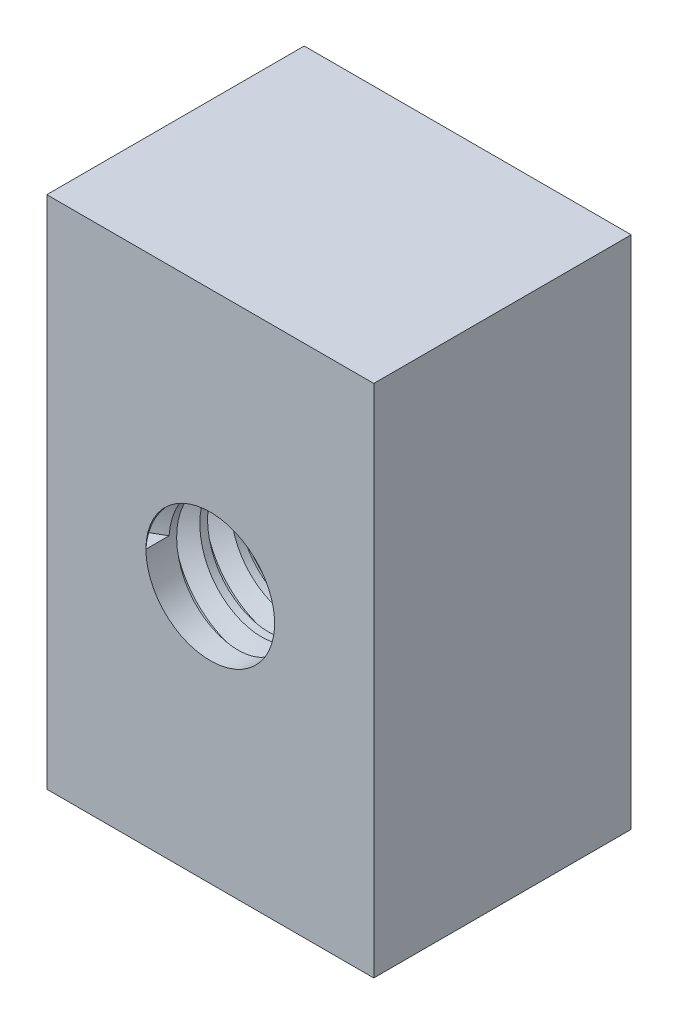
ISO-10303-21;
HEADER;
FILE_DESCRIPTION(('STEP AP214'),'2;1');
FILE_NAME('part.step','',(''),(''),'','','');
FILE_SCHEMA(('AUTOMOTIVE_DESIGN { 1 0 10303 214 1 1 1 1 }'));
ENDSEC;
DATA;
#1=APPLICATION_CONTEXT('core data for automotive mechanical design processes');
#2=APPLICATION_PROTOCOL_DEFINITION('international standard','automotive_design',2000,#1);
#3=PRODUCT_CONTEXT('',#1,'mechanical');
#4=PRODUCT('Part','Part','',(#3));
#5=PRODUCT_RELATED_PRODUCT_CATEGORY('part','',(#4));
#6=PRODUCT_DEFINITION_FORMATION('','',#4);
#7=PRODUCT_DEFINITION_CONTEXT('part definition',#1,'design');
#8=PRODUCT_DEFINITION('design','',#6,#7);
#9=PRODUCT_DEFINITION_SHAPE('','',#8);
#10=(LENGTH_UNIT() NAMED_UNIT(*) SI_UNIT(.MILLI.,.METRE.));
#11=(NAMED_UNIT(*) PLANE_ANGLE_UNIT() SI_UNIT($,.RADIAN.));
#12=(NAMED_UNIT(*) SI_UNIT($,.STERADIAN.) SOLID_ANGLE_UNIT());
#13=UNCERTAINTY_MEASURE_WITH_UNIT(LENGTH_MEASURE(1.E-05),#10,'distance_accuracy_value','');
#14=(GEOMETRIC_REPRESENTATION_CONTEXT(3) GLOBAL_UNCERTAINTY_ASSIGNED_CONTEXT((#13)) GLOBAL_UNIT_ASSIGNED_CONTEXT((#10,
#11,#12)) REPRESENTATION_CONTEXT('',''));
#15=CARTESIAN_POINT('',(0.,0.,0.));
#16=DIRECTION('',(0.,0.,1.));
#17=DIRECTION('',(1.,0.,0.));
#18=AXIS2_PLACEMENT_3D('',#15,#16,#17);
#19=CARTESIAN_POINT('',(0.,0.,0.));
#20=DIRECTION('',(0.,0.,1.));
#21=DIRECTION('',(1.,0.,0.));
#22=AXIS2_PLACEMENT_3D('',#19,#20,#21);
#23=PLANE('',#22);
#24=DIRECTION('',(0.,-1.,0.));
#25=VECTOR('',#24,1.);
#26=CARTESIAN_POINT('',(-3.175,-5.,0.));
#27=LINE('',#26,#25);
#28=CARTESIAN_POINT('',(-3.175,5.,0.));
#29=VERTEX_POINT('',#28);
#30=CARTESIAN_POINT('',(-3.175,-5.,0.));
#31=VERTEX_POINT('',#30);
#32=EDGE_CURVE('E236',#29,#31,#27,.T.);
#33=ORIENTED_EDGE('',*,*,#32,.F.);
#34=DIRECTION('',(-1.,0.,0.));
#35=VECTOR('',#34,1.);
#36=CARTESIAN_POINT('',(3.175,5.,0.));
#37=LINE('',#36,#35);
#38=CARTESIAN_POINT('',(3.175,5.,0.));
#39=VERTEX_POINT('',#38);
#40=EDGE_CURVE('E83',#39,#29,#37,.T.);
#41=ORIENTED_EDGE('',*,*,#40,.F.);
#42=DIRECTION('',(0.,1.,0.));
#43=VECTOR('',#42,1.);
#44=CARTESIAN_POINT('',(3.175,-5.,0.));
#45=LINE('',#44,#43);
#46=CARTESIAN_POINT('',(3.175,-5.,0.));
#47=VERTEX_POINT('',#46);
#48=EDGE_CURVE('E252',#47,#39,#45,.T.);
#49=ORIENTED_EDGE('',*,*,#48,.F.);
#50=DIRECTION('',(1.,0.,0.));
#51=VECTOR('',#50,1.);
#52=CARTESIAN_POINT('',(3.175,-5.,0.));
#53=LINE('',#52,#51);
#54=EDGE_CURVE('E250',#31,#47,#53,.T.);
#55=ORIENTED_EDGE('',*,*,#54,.F.);
#56=EDGE_LOOP('',(#33,#41,#49,#55));
#57=FACE_BOUND('',#56,.T.);
#58=CARTESIAN_POINT('',(-1.55952693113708,0.218502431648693,0.));
#59=CARTESIAN_POINT('',(-1.54266298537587,0.287310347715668,0.));
#60=CARTESIAN_POINT('',(-1.5208864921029,0.35489146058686,0.));
#61=CARTESIAN_POINT('',(-1.46807137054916,0.486296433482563,0.));
#62=CARTESIAN_POINT('',(-1.43703704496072,0.550122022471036,0.));
#63=CARTESIAN_POINT('',(-1.35941561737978,0.684625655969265,0.));
#64=CARTESIAN_POINT('',(-1.31098219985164,0.754245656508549,0.));
#65=CARTESIAN_POINT('',(-1.20301690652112,0.884416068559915,0.));
#66=CARTESIAN_POINT('',(-1.14347553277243,0.94495863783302,0.));
#67=CARTESIAN_POINT('',(-1.04731315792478,1.02749564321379,0.));
#68=CARTESIAN_POINT('',(-1.01414515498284,1.05361176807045,0.));
#69=CARTESIAN_POINT('',(-0.945712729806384,1.10297362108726,0.));
#70=CARTESIAN_POINT('',(-0.910447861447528,1.12621873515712,0.));
#71=CARTESIAN_POINT('',(-0.838106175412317,1.16963780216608,0.));
#72=CARTESIAN_POINT('',(-0.801030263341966,1.18981326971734,0.));
#73=CARTESIAN_POINT('',(-0.725327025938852,1.22700148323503,0.));
#74=CARTESIAN_POINT('',(-0.686700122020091,1.24401508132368,0.));
#75=CARTESIAN_POINT('',(-0.608377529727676,1.27410990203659,0.));
#76=CARTESIAN_POINT('',(-0.568696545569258,1.28722904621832,0.));
#77=CARTESIAN_POINT('',(-0.488295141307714,1.3097008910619,0.));
#78=CARTESIAN_POINT('',(-0.447574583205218,1.31905308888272,0.));
#79=CARTESIAN_POINT('',(-0.324410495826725,1.3412722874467,0.));
#80=CARTESIAN_POINT('',(-0.240833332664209,1.34835214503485,0.));
#81=CARTESIAN_POINT('',(-0.0825294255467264,1.34680324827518,0.));
#82=CARTESIAN_POINT('',(-0.00777719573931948,1.3397164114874,0.));
#83=CARTESIAN_POINT('',(0.139488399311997,1.31304258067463,0.));
#84=CARTESIAN_POINT('',(0.212001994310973,1.29345687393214,0.));
#85=CARTESIAN_POINT('',(0.343601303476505,1.2456390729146,0.));
#86=CARTESIAN_POINT('',(0.403214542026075,1.21884300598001,0.));
#87=CARTESIAN_POINT('',(0.517847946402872,1.15683746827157,0.));
#88=CARTESIAN_POINT('',(0.572870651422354,1.12163269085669,0.));
#89=CARTESIAN_POINT('',(0.625,1.08253175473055,0.));
#90=B_SPLINE_CURVE_WITH_KNOTS('',3,(#58,#59,#60,#61,#62,#63,#64,#65,#66,#67,#68,#69,#70,#71,#72,
#73,#74,#75,#76,#77,#78,#79,#80,#81,#82,#83,#84,#85,#86,#87,#88,#89),.UNSPECIFIED.,.F.,.F.,(4,2,
2,2,2,2,2,2,2,2,2,2,2,2,2,4),(0.,0.212318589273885,0.424538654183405,0.677754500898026,
0.931187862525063,1.05771210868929,1.18426337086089,1.31075198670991,1.4372064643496,
1.56238586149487,1.68758196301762,1.9375591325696,2.1618054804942,2.38602873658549,
2.58141369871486,2.77668985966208),.UNSPECIFIED.);
#91=CARTESIAN_POINT('',(-1.55952693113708,0.218502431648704,0.));
#92=VERTEX_POINT('',#91);
#93=CARTESIAN_POINT('',(0.625,1.08253175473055,0.));
#94=VERTEX_POINT('',#93);
#95=EDGE_CURVE('E173',#92,#94,#90,.T.);
#96=ORIENTED_EDGE('',*,*,#95,.F.);
#97=CARTESIAN_POINT('',(-1.25466279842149,-0.951676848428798,0.));
#98=CARTESIAN_POINT('',(-1.28493246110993,-0.91178399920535,0.));
#99=CARTESIAN_POINT('',(-1.31328581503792,-0.870438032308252,0.));
#100=CARTESIAN_POINT('',(-1.36253546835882,-0.79073450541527,0.));
#101=CARTESIAN_POINT('',(-1.38392189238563,-0.752679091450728,0.));
#102=CARTESIAN_POINT('',(-1.42348169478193,-0.674890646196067,0.));
#103=CARTESIAN_POINT('',(-1.44165151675,-0.635155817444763,0.));
#104=CARTESIAN_POINT('',(-1.49154563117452,-0.512805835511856,0.));
#105=CARTESIAN_POINT('',(-1.51806487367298,-0.427998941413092,0.));
#106=CARTESIAN_POINT('',(-1.55648843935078,-0.255076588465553,0.));
#107=CARTESIAN_POINT('',(-1.56838165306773,-0.166958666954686,0.));
#108=CARTESIAN_POINT('',(-1.57528074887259,-0.0288879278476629,0.));
#109=CARTESIAN_POINT('',(-1.57540495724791,0.0208562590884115,0.));
#110=CARTESIAN_POINT('',(-1.57096265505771,0.120002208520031,0.));
#111=CARTESIAN_POINT('',(-1.56640860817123,0.169404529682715,0.));
#112=CARTESIAN_POINT('',(-1.55952693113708,0.218502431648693,0.));
#113=B_SPLINE_CURVE_WITH_KNOTS('',3,(#97,#98,#99,#100,#101,#102,#103,#104,#105,#106,#107,#108,
#109,#110,#111,#112),.UNSPECIFIED.,.F.,.F.,(4,2,2,2,2,2,2,4),(0.,0.150170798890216,
0.280977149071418,0.411927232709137,0.677149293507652,0.942572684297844,1.0916044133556,
1.24024012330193),.UNSPECIFIED.);
#114=CARTESIAN_POINT('',(-1.25466279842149,-0.951676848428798,0.));
#115=VERTEX_POINT('',#114);
#116=EDGE_CURVE('E11',#115,#92,#113,.T.);
#117=ORIENTED_EDGE('',*,*,#116,.F.);
#118=CARTESIAN_POINT('',(1.08253174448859,-0.625000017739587,0.));
#119=CARTESIAN_POINT('',(1.06937610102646,-0.657376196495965,0.));
#120=CARTESIAN_POINT('',(1.05486059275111,-0.689175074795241,0.));
#121=CARTESIAN_POINT('',(1.02319310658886,-0.751446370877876,0.));
#122=CARTESIAN_POINT('',(1.00604016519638,-0.781918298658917,0.));
#123=CARTESIAN_POINT('',(0.950989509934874,-0.870690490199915,0.));
#124=CARTESIAN_POINT('',(0.909338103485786,-0.926744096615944,0.));
#125=CARTESIAN_POINT('',(0.840313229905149,-1.00499613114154,0.));
#126=CARTESIAN_POINT('',(0.816171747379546,-1.0301426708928,0.));
#127=CARTESIAN_POINT('',(0.765867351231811,-1.07834251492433,0.));
#128=CARTESIAN_POINT('',(0.739704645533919,-1.10139603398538,0.));
#129=CARTESIAN_POINT('',(0.685499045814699,-1.14522030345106,0.));
#130=CARTESIAN_POINT('',(0.657454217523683,-1.16598864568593,0.));
#131=CARTESIAN_POINT('',(0.599919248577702,-1.20542355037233,0.));
#132=CARTESIAN_POINT('',(0.570428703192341,-1.22408951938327,0.));
#133=CARTESIAN_POINT('',(0.508717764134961,-1.26001820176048,0.));
#134=CARTESIAN_POINT('',(0.4764342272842,-1.27717279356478,0.));
#135=CARTESIAN_POINT('',(0.410650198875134,-1.30892634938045,0.));
#136=CARTESIAN_POINT('',(0.377150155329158,-1.32352624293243,0.));
#137=CARTESIAN_POINT('',(0.309124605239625,-1.35008459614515,0.));
#138=CARTESIAN_POINT('',(0.274599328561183,-1.36204364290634,0.));
#139=CARTESIAN_POINT('',(0.204701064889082,-1.38326204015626,0.));
#140=CARTESIAN_POINT('',(0.169327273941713,-1.3925187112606,0.));
#141=CARTESIAN_POINT('',(0.056077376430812,-1.41749278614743,0.));
#142=CARTESIAN_POINT('',(-0.0230001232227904,-1.42805889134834,0.));
#143=CARTESIAN_POINT('',(-0.181816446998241,-1.43574825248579,0.));
#144=CARTESIAN_POINT('',(-0.261555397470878,-1.43286887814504,0.));
#145=CARTESIAN_POINT('',(-0.379892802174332,-1.41858749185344,0.));
#146=CARTESIAN_POINT('',(-0.419147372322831,-1.41216054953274,0.));
#147=CARTESIAN_POINT('',(-0.4969415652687,-1.39603724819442,0.));
#148=CARTESIAN_POINT('',(-0.53548194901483,-1.38634460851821,0.));
#149=CARTESIAN_POINT('',(-0.611667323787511,-1.36376132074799,0.));
#150=CARTESIAN_POINT('',(-0.649311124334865,-1.35086665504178,0.));
#151=CARTESIAN_POINT('',(-0.723373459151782,-1.32191579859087,0.));
#152=CARTESIAN_POINT('',(-0.759791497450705,-1.3058583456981,0.));
#153=CARTESIAN_POINT('',(-0.831691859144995,-1.27087920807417,0.));
#154=CARTESIAN_POINT('',(-0.867160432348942,-1.25192935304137,0.));
#155=CARTESIAN_POINT('',(-0.936552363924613,-1.21140623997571,0.));
#156=CARTESIAN_POINT('',(-0.970475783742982,-1.18983308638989,0.));
#157=CARTESIAN_POINT('',(-1.06953432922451,-1.12140681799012,0.));
#158=CARTESIAN_POINT('',(-1.13213089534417,-1.07076256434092,0.));
#159=CARTESIAN_POINT('',(-1.21249927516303,-0.994999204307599,0.));
#160=CARTESIAN_POINT('',(-1.23390495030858,-0.973630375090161,0.));
#161=CARTESIAN_POINT('',(-1.25466279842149,-0.951676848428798,0.));
#162=B_SPLINE_CURVE_WITH_KNOTS('',3,(#118,#119,#120,#121,#122,#123,#124,#125,#126,#127,#128,
#129,#130,#131,#132,#133,#134,#135,#136,#137,#138,#139,#140,#141,#142,#143,#144,#145,#146,#147,
#148,#149,#150,#151,#152,#153,#154,#155,#156,#157,#158,#159,#160,#161),.UNSPECIFIED.,.F.,.F.,(4,
2,2,2,2,2,2,2,2,2,2,2,2,2,2,2,2,2,2,2,2,4),(0.,0.104763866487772,0.209566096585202,
0.417900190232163,0.522386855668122,0.62686278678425,0.731447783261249,0.836062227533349,
0.945624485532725,1.05514679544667,1.16464473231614,1.27425086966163,1.51237625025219,
1.75054821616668,1.86976148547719,1.98883943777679,2.10806755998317,2.22734335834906,
2.34786523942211,2.46838232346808,2.70884435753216,2.79952452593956),.UNSPECIFIED.);
#163=CARTESIAN_POINT('',(1.08253174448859,-0.625000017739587,0.));
#164=VERTEX_POINT('',#163);
#165=EDGE_CURVE('E166',#164,#115,#162,.T.);
#166=ORIENTED_EDGE('',*,*,#165,.F.);
#167=CARTESIAN_POINT('',(0.,0.,0.));
#168=DIRECTION('',(0.,0.,1.));
#169=DIRECTION('',(1.,0.,0.));
#170=AXIS2_PLACEMENT_3D('',#167,#168,#169);
#171=CIRCLE('',#170,1.25);
#172=EDGE_CURVE('E132',#164,#94,#171,.T.);
#173=ORIENTED_EDGE('',*,*,#172,.T.);
#174=EDGE_LOOP('',(#96,#117,#166,#173));
#175=FACE_BOUND('',#174,.T.);
#176=ADVANCED_FACE('F33',(#57,#175),#23,.F.);
#177=CARTESIAN_POINT('',(0.,0.,0.));
#178=DIRECTION('',(0.,0.,1.));
#179=DIRECTION('',(1.,0.,0.));
#180=AXIS2_PLACEMENT_3D('',#177,#178,#179);
#181=CYLINDRICAL_SURFACE('',#180,1.25);
#182=CARTESIAN_POINT('',(-1.25,0.,4.55000000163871));
#183=CARTESIAN_POINT('',(-1.25,0.721687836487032,4.50000000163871));
#184=CARTESIAN_POINT('',(-0.625,1.08253175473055,4.45000000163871));
#185=CARTESIAN_POINT('',(0.,1.44337567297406,4.40000000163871));
#186=CARTESIAN_POINT('',(0.625,1.08253175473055,4.35000000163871));
#187=CARTESIAN_POINT('',(1.25,0.721687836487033,4.30000000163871));
#188=CARTESIAN_POINT('',(1.25,0.,4.25000000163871));
#189=CARTESIAN_POINT('',(1.25,-0.721687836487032,4.20000000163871));
#190=CARTESIAN_POINT('',(0.625000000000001,-1.08253175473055,4.15000000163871));
#191=CARTESIAN_POINT('',(0.,-1.44337567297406,4.10000000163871));
#192=CARTESIAN_POINT('',(-0.624999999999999,-1.08253175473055,4.05000000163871));
#193=CARTESIAN_POINT('',(-1.25,-0.721687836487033,4.00000000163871));
#194=CARTESIAN_POINT('',(-1.25,0.,3.95000000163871));
#195=CARTESIAN_POINT('',(-1.25,0.721687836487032,3.90000000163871));
#196=CARTESIAN_POINT('',(-0.625,1.08253175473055,3.85000000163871));
#197=CARTESIAN_POINT('',(0.,1.44337567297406,3.80000000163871));
#198=CARTESIAN_POINT('',(0.625,1.08253175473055,3.75000000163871));
#199=CARTESIAN_POINT('',(1.25,0.721687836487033,3.70000000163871));
#200=CARTESIAN_POINT('',(1.25,0.,3.65000000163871));
#201=CARTESIAN_POINT('',(1.25,-0.721687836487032,3.60000000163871));
#202=CARTESIAN_POINT('',(0.625000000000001,-1.08253175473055,3.55000000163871));
#203=CARTESIAN_POINT('',(0.,-1.44337567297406,3.50000000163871));
#204=CARTESIAN_POINT('',(-0.624999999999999,-1.08253175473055,3.45000000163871));
#205=CARTESIAN_POINT('',(-1.25,-0.721687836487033,3.40000000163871));
#206=CARTESIAN_POINT('',(-1.25,0.,3.35000000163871));
#207=CARTESIAN_POINT('',(-1.25,0.721687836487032,3.30000000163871));
#208=CARTESIAN_POINT('',(-0.625,1.08253175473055,3.25000000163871));
#209=CARTESIAN_POINT('',(0.,1.44337567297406,3.20000000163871));
#210=CARTESIAN_POINT('',(0.625,1.08253175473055,3.15000000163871));
#211=CARTESIAN_POINT('',(1.25,0.721687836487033,3.10000000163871));
#212=CARTESIAN_POINT('',(1.25,0.,3.05000000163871));
#213=CARTESIAN_POINT('',(1.25,-0.721687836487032,3.00000000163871));
#214=CARTESIAN_POINT('',(0.625000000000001,-1.08253175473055,2.95000000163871));
#215=CARTESIAN_POINT('',(0.,-1.44337567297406,2.90000000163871));
#216=CARTESIAN_POINT('',(-0.624999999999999,-1.08253175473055,2.85000000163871));
#217=CARTESIAN_POINT('',(-1.25,-0.721687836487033,2.80000000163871));
#218=CARTESIAN_POINT('',(-1.25,0.,2.75000000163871));
#219=CARTESIAN_POINT('',(-1.25,0.721687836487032,2.70000000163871));
#220=CARTESIAN_POINT('',(-0.625,1.08253175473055,2.65000000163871));
#221=CARTESIAN_POINT('',(0.,1.44337567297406,2.60000000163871));
#222=CARTESIAN_POINT('',(0.625,1.08253175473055,2.55000000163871));
#223=CARTESIAN_POINT('',(1.25,0.721687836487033,2.50000000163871));
#224=CARTESIAN_POINT('',(1.25,0.,2.45000000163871));
#225=CARTESIAN_POINT('',(1.25,-0.721687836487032,2.40000000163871));
#226=CARTESIAN_POINT('',(0.625000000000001,-1.08253175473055,2.35000000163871));
#227=CARTESIAN_POINT('',(0.,-1.44337567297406,2.30000000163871));
#228=CARTESIAN_POINT('',(-0.624999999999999,-1.08253175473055,2.25000000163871));
#229=CARTESIAN_POINT('',(-1.25,-0.721687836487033,2.20000000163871));
#230=CARTESIAN_POINT('',(-1.25,0.,2.15000000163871));
#231=CARTESIAN_POINT('',(-1.25,0.721687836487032,2.10000000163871));
#232=CARTESIAN_POINT('',(-0.625,1.08253175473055,2.05000000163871));
#233=CARTESIAN_POINT('',(0.,1.44337567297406,2.00000000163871));
#234=CARTESIAN_POINT('',(0.625,1.08253175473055,1.95000000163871));
#235=CARTESIAN_POINT('',(1.25,0.721687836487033,1.90000000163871));
#236=CARTESIAN_POINT('',(1.25,0.,1.85000000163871));
#237=CARTESIAN_POINT('',(1.25,-0.721687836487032,1.80000000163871));
#238=CARTESIAN_POINT('',(0.625000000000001,-1.08253175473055,1.75000000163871));
#239=CARTESIAN_POINT('',(0.,-1.44337567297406,1.70000000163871));
#240=CARTESIAN_POINT('',(-0.624999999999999,-1.08253175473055,1.65000000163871));
#241=CARTESIAN_POINT('',(-1.25,-0.721687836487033,1.60000000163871));
#242=CARTESIAN_POINT('',(-1.25,0.,1.55000000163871));
#243=CARTESIAN_POINT('',(-1.25,0.721687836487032,1.50000000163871));
#244=CARTESIAN_POINT('',(-0.625,1.08253175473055,1.45000000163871));
#245=CARTESIAN_POINT('',(0.,1.44337567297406,1.40000000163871));
#246=CARTESIAN_POINT('',(0.625,1.08253175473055,1.35000000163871));
#247=CARTESIAN_POINT('',(1.25,0.721687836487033,1.30000000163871));
#248=CARTESIAN_POINT('',(1.25,0.,1.25000000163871));
#249=CARTESIAN_POINT('',(1.25,-0.721687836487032,1.20000000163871));
#250=CARTESIAN_POINT('',(0.625000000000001,-1.08253175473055,1.15000000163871));
#251=CARTESIAN_POINT('',(0.,-1.44337567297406,1.10000000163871));
#252=CARTESIAN_POINT('',(-0.624999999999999,-1.08253175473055,1.05000000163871));
#253=CARTESIAN_POINT('',(-1.25,-0.721687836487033,1.00000000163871));
#254=CARTESIAN_POINT('',(-1.25,0.,0.950000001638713));
#255=CARTESIAN_POINT('',(-1.25,0.721687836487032,0.900000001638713));
#256=CARTESIAN_POINT('',(-0.625,1.08253175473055,0.850000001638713));
#257=CARTESIAN_POINT('',(0.,1.44337567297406,0.800000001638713));
#258=CARTESIAN_POINT('',(0.625,1.08253175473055,0.750000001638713));
#259=CARTESIAN_POINT('',(1.25,0.721687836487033,0.700000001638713));
#260=CARTESIAN_POINT('',(1.25,0.,0.650000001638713));
#261=CARTESIAN_POINT('',(1.25,-0.721687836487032,0.600000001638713));
#262=CARTESIAN_POINT('',(0.625000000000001,-1.08253175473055,0.550000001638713));
#263=CARTESIAN_POINT('',(0.,-1.44337567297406,0.500000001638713));
#264=CARTESIAN_POINT('',(-0.624999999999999,-1.08253175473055,0.450000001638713));
#265=CARTESIAN_POINT('',(-1.25,-0.721687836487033,0.400000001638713));
#266=CARTESIAN_POINT('',(-1.25,0.,0.350000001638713));
#267=CARTESIAN_POINT('',(-1.25,0.721687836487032,0.300000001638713));
#268=CARTESIAN_POINT('',(-0.625,1.08253175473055,0.250000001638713));
#269=CARTESIAN_POINT('',(0.,1.44337567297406,0.200000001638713));
#270=CARTESIAN_POINT('',(0.625,1.08253175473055,0.150000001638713));
#271=CARTESIAN_POINT('',(1.25,0.721687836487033,0.100000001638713));
#272=CARTESIAN_POINT('',(1.25,0.,0.0500000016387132));
#273=CARTESIAN_POINT('',(1.25,-0.721687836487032,1.63871347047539E-09));
#274=CARTESIAN_POINT('',(0.625000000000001,-1.08253175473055,-0.0499999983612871));
#275=CARTESIAN_POINT('',(0.,-1.44337567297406,-0.0999999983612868));
#276=CARTESIAN_POINT('',(-0.624999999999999,-1.08253175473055,-0.149999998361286));
#277=CARTESIAN_POINT('',(-1.25,-0.721687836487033,-0.199999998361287));
#278=CARTESIAN_POINT('',(-1.25,0.,-0.249999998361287));
#279=CARTESIAN_POINT('',(-1.25,0.721687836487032,-0.299999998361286));
#280=CARTESIAN_POINT('',(-0.625,1.08253175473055,-0.349999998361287));
#281=CARTESIAN_POINT('',(0.,1.44337567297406,-0.399999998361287));
#282=CARTESIAN_POINT('',(0.625,1.08253175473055,-0.449999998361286));
#283=CARTESIAN_POINT('',(1.25,0.721687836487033,-0.499999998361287));
#284=CARTESIAN_POINT('',(1.25,0.,-0.549999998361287));
#285=CARTESIAN_POINT('',(1.25,-0.721687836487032,-0.599999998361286));
#286=CARTESIAN_POINT('',(0.625000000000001,-1.08253175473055,-0.649999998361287));
#287=CARTESIAN_POINT('',(0.,-1.44337567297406,-0.699999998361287));
#288=CARTESIAN_POINT('',(-0.624999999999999,-1.08253175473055,-0.749999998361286));
#289=CARTESIAN_POINT('',(-1.25,-0.721687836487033,-0.799999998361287));
#290=CARTESIAN_POINT('',(-1.25,0.,-0.849999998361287));
#291=CARTESIAN_POINT('',(-1.25,0.721687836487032,-0.899999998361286));
#292=CARTESIAN_POINT('',(-0.625,1.08253175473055,-0.949999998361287));
#293=CARTESIAN_POINT('',(0.,1.44337567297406,-0.999999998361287));
#294=CARTESIAN_POINT('',(0.625,1.08253175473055,-1.04999999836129));
#295=CARTESIAN_POINT('',(1.25,0.721687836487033,-1.09999999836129));
#296=CARTESIAN_POINT('',(1.25,0.,-1.14999999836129));
#297=CARTESIAN_POINT('',(1.25,-0.721687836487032,-1.19999999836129));
#298=CARTESIAN_POINT('',(0.625000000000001,-1.08253175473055,-1.24999999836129));
#299=CARTESIAN_POINT('',(0.,-1.44337567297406,-1.29999999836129));
#300=CARTESIAN_POINT('',(-0.624999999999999,-1.08253175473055,-1.34999999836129));
#301=CARTESIAN_POINT('',(-1.25,-0.721687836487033,-1.39999999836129));
#302=CARTESIAN_POINT('',(-1.25,0.,-1.44999999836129));
#303=(BOUNDED_CURVE() B_SPLINE_CURVE(2,(#182,#183,#184,#185,#186,#187,#188,#189,#190,#191,#192,
#193,#194,#195,#196,#197,#198,#199,#200,#201,#202,#203,#204,#205,#206,#207,#208,#209,#210,#211,
#212,#213,#214,#215,#216,#217,#218,#219,#220,#221,#222,#223,#224,#225,#226,#227,#228,#229,#230,
#231,#232,#233,#234,#235,#236,#237,#238,#239,#240,#241,#242,#243,#244,#245,#246,#247,#248,#249,
#250,#251,#252,#253,#254,#255,#256,#257,#258,#259,#260,#261,#262,#263,#264,#265,#266,#267,#268,
#269,#270,#271,#272,#273,#274,#275,#276,#277,#278,#279,#280,#281,#282,#283,#284,#285,#286,#287,
#288,#289,#290,#291,#292,#293,#294,#295,#296,#297,#298,#299,#300,#301,#302),.UNSPECIFIED.,.F.,
.F.) B_SPLINE_CURVE_WITH_KNOTS((3,2,2,2,2,2,2,2,2,2,2,2,2,2,2,2,2,2,2,2,2,2,2,2,2,2,2,2,2,2,2,2,
2,2,2,2,2,2,2,2,2,2,2,2,2,2,2,2,2,2,2,2,2,2,2,2,2,2,2,2,3),(0.,0.0166666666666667,
0.0333333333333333,0.05,0.0666666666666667,0.0833333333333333,0.1,0.116666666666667,
0.133333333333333,0.15,0.166666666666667,0.183333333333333,0.2,0.216666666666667,
0.233333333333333,0.25,0.266666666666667,0.283333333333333,0.3,0.316666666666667,
0.333333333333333,0.35,0.366666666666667,0.383333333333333,0.4,0.416666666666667,
0.433333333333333,0.45,0.466666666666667,0.483333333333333,0.5,0.516666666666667,
0.533333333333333,0.55,0.566666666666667,0.583333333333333,0.6,0.616666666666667,
0.633333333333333,0.65,0.666666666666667,0.683333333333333,0.7,0.716666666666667,
0.733333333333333,0.75,0.766666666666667,0.783333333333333,0.8,0.816666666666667,
0.833333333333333,0.85,0.866666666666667,0.883333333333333,0.9,0.916666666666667,
0.933333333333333,0.95,0.966666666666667,0.983333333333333,1.),
.UNSPECIFIED.) CURVE() GEOMETRIC_REPRESENTATION_ITEM() RATIONAL_B_SPLINE_CURVE((1.,
0.866025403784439,1.,0.866025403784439,1.,0.866025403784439,1.,0.866025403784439,1.,
0.866025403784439,1.,0.866025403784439,1.,0.866025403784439,1.,0.866025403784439,1.,
0.866025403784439,1.,0.866025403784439,1.,0.866025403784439,1.,0.866025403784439,1.,
0.866025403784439,1.,0.866025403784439,1.,0.866025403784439,1.,0.866025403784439,1.,
0.866025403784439,1.,0.866025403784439,1.,0.866025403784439,1.,0.866025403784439,1.,
0.866025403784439,1.,0.866025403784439,1.,0.866025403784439,1.,0.866025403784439,1.,
0.866025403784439,1.,0.866025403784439,1.,0.866025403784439,1.,0.866025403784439,1.,
0.866025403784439,1.,0.866025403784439,1.,0.866025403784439,1.,0.866025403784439,1.,
0.866025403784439,1.,0.866025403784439,1.,0.866025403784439,1.,0.866025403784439,1.,
0.866025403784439,1.,0.866025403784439,1.,0.866025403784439,1.,0.866025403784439,1.,
0.866025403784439,1.,0.866025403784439,1.,0.866025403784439,1.,0.866025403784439,1.,
0.866025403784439,1.,0.866025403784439,1.,0.866025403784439,1.,0.866025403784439,1.,
0.866025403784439,1.,0.866025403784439,1.,0.866025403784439,1.,0.866025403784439,1.,
0.866025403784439,1.,0.866025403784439,1.,0.866025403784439,1.,0.866025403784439,1.,
0.866025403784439,1.,0.866025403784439,1.,0.866025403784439,1.,0.866025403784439,1.)) REPRESENTATION_ITEM(''));
#304=CARTESIAN_POINT('',(-1.25,0.,4.55000000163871));
#305=VERTEX_POINT('',#304);
#306=EDGE_CURVE('E53',#305,#164,#303,.T.);
#307=ORIENTED_EDGE('',*,*,#306,.F.);
#308=DIRECTION('',(0.,0.,1.));
#309=VECTOR('',#308,1.);
#310=CARTESIAN_POINT('',(-1.25,0.,4.77500000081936));
#311=LINE('',#310,#309);
#312=CARTESIAN_POINT('',(-1.25,0.,5.));
#313=VERTEX_POINT('',#312);
#314=EDGE_CURVE('E121',#305,#313,#311,.T.);
#315=ORIENTED_EDGE('',*,*,#314,.T.);
#316=CARTESIAN_POINT('',(0.,0.,5.));
#317=DIRECTION('',(0.,0.,1.));
#318=DIRECTION('',(1.,0.,0.));
#319=AXIS2_PLACEMENT_3D('',#316,#317,#318);
#320=CIRCLE('',#319,1.25);
#321=EDGE_CURVE('E239',#313,#313,#320,.T.);
#322=ORIENTED_EDGE('',*,*,#321,.T.);
#323=CARTESIAN_POINT('',(-1.25,0.,5.));
#324=CARTESIAN_POINT('',(-1.25,0.721687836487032,4.95));
#325=CARTESIAN_POINT('',(-0.625,1.08253175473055,4.9));
#326=CARTESIAN_POINT('',(0.,1.44337567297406,4.85));
#327=CARTESIAN_POINT('',(0.625,1.08253175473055,4.8));
#328=CARTESIAN_POINT('',(1.25,0.721687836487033,4.75));
#329=CARTESIAN_POINT('',(1.25,0.,4.7));
#330=CARTESIAN_POINT('',(1.25,-0.721687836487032,4.65));
#331=CARTESIAN_POINT('',(0.625000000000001,-1.08253175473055,4.6));
#332=CARTESIAN_POINT('',(0.,-1.44337567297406,4.55));
#333=CARTESIAN_POINT('',(-0.624999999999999,-1.08253175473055,4.5));
#334=CARTESIAN_POINT('',(-1.25,-0.721687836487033,4.45));
#335=CARTESIAN_POINT('',(-1.25,0.,4.4));
#336=CARTESIAN_POINT('',(-1.25,0.721687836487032,4.35));
#337=CARTESIAN_POINT('',(-0.625,1.08253175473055,4.3));
#338=CARTESIAN_POINT('',(0.,1.44337567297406,4.25));
#339=CARTESIAN_POINT('',(0.625,1.08253175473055,4.2));
#340=CARTESIAN_POINT('',(1.25,0.721687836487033,4.15));
#341=CARTESIAN_POINT('',(1.25,0.,4.1));
#342=CARTESIAN_POINT('',(1.25,-0.721687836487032,4.05));
#343=CARTESIAN_POINT('',(0.625000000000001,-1.08253175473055,4.));
#344=CARTESIAN_POINT('',(0.,-1.44337567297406,3.95));
#345=CARTESIAN_POINT('',(-0.624999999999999,-1.08253175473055,3.9));
#346=CARTESIAN_POINT('',(-1.25,-0.721687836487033,3.85));
#347=CARTESIAN_POINT('',(-1.25,0.,3.8));
#348=CARTESIAN_POINT('',(-1.25,0.721687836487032,3.75));
#349=CARTESIAN_POINT('',(-0.625,1.08253175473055,3.7));
#350=CARTESIAN_POINT('',(0.,1.44337567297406,3.65));
#351=CARTESIAN_POINT('',(0.625,1.08253175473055,3.6));
#352=CARTESIAN_POINT('',(1.25,0.721687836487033,3.55));
#353=CARTESIAN_POINT('',(1.25,0.,3.5));
#354=CARTESIAN_POINT('',(1.25,-0.721687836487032,3.45));
#355=CARTESIAN_POINT('',(0.625000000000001,-1.08253175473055,3.4));
#356=CARTESIAN_POINT('',(0.,-1.44337567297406,3.35));
#357=CARTESIAN_POINT('',(-0.624999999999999,-1.08253175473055,3.3));
#358=CARTESIAN_POINT('',(-1.25,-0.721687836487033,3.25));
#359=CARTESIAN_POINT('',(-1.25,0.,3.2));
#360=CARTESIAN_POINT('',(-1.25,0.721687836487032,3.15));
#361=CARTESIAN_POINT('',(-0.625,1.08253175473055,3.1));
#362=CARTESIAN_POINT('',(0.,1.44337567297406,3.05));
#363=CARTESIAN_POINT('',(0.625,1.08253175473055,3.));
#364=CARTESIAN_POINT('',(1.25,0.721687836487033,2.95));
#365=CARTESIAN_POINT('',(1.25,0.,2.9));
#366=CARTESIAN_POINT('',(1.25,-0.721687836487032,2.85));
#367=CARTESIAN_POINT('',(0.625000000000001,-1.08253175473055,2.8));
#368=CARTESIAN_POINT('',(0.,-1.44337567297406,2.75));
#369=CARTESIAN_POINT('',(-0.624999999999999,-1.08253175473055,2.7));
#370=CARTESIAN_POINT('',(-1.25,-0.721687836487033,2.65));
#371=CARTESIAN_POINT('',(-1.25,0.,2.6));
#372=CARTESIAN_POINT('',(-1.25,0.721687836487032,2.55));
#373=CARTESIAN_POINT('',(-0.625,1.08253175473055,2.5));
#374=CARTESIAN_POINT('',(0.,1.44337567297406,2.45));
#375=CARTESIAN_POINT('',(0.625,1.08253175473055,2.4));
#376=CARTESIAN_POINT('',(1.25,0.721687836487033,2.35));
#377=CARTESIAN_POINT('',(1.25,0.,2.3));
#378=CARTESIAN_POINT('',(1.25,-0.721687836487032,2.25));
#379=CARTESIAN_POINT('',(0.625000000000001,-1.08253175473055,2.2));
#380=CARTESIAN_POINT('',(0.,-1.44337567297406,2.15));
#381=CARTESIAN_POINT('',(-0.624999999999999,-1.08253175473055,2.1));
#382=CARTESIAN_POINT('',(-1.25,-0.721687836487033,2.05));
#383=CARTESIAN_POINT('',(-1.25,0.,2.));
#384=CARTESIAN_POINT('',(-1.25,0.721687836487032,1.95));
#385=CARTESIAN_POINT('',(-0.625,1.08253175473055,1.9));
#386=CARTESIAN_POINT('',(0.,1.44337567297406,1.85));
#387=CARTESIAN_POINT('',(0.625,1.08253175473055,1.8));
#388=CARTESIAN_POINT('',(1.25,0.721687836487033,1.75));
#389=CARTESIAN_POINT('',(1.25,0.,1.7));
#390=CARTESIAN_POINT('',(1.25,-0.721687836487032,1.65));
#391=CARTESIAN_POINT('',(0.625000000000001,-1.08253175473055,1.6));
#392=CARTESIAN_POINT('',(0.,-1.44337567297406,1.55));
#393=CARTESIAN_POINT('',(-0.624999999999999,-1.08253175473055,1.5));
#394=CARTESIAN_POINT('',(-1.25,-0.721687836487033,1.45));
#395=CARTESIAN_POINT('',(-1.25,0.,1.4));
#396=CARTESIAN_POINT('',(-1.25,0.721687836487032,1.35));
#397=CARTESIAN_POINT('',(-0.625,1.08253175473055,1.3));
#398=CARTESIAN_POINT('',(0.,1.44337567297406,1.25));
#399=CARTESIAN_POINT('',(0.625,1.08253175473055,1.2));
#400=CARTESIAN_POINT('',(1.25,0.721687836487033,1.15));
#401=CARTESIAN_POINT('',(1.25,0.,1.1));
#402=CARTESIAN_POINT('',(1.25,-0.721687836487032,1.05));
#403=CARTESIAN_POINT('',(0.625000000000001,-1.08253175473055,1.));
#404=CARTESIAN_POINT('',(0.,-1.44337567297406,0.95));
#405=CARTESIAN_POINT('',(-0.624999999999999,-1.08253175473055,0.900000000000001));
#406=CARTESIAN_POINT('',(-1.25,-0.721687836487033,0.85));
#407=CARTESIAN_POINT('',(-1.25,0.,0.8));
#408=CARTESIAN_POINT('',(-1.25,0.721687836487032,0.750000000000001));
#409=CARTESIAN_POINT('',(-0.625,1.08253175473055,0.7));
#410=CARTESIAN_POINT('',(0.,1.44337567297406,0.65));
#411=CARTESIAN_POINT('',(0.625,1.08253175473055,0.600000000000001));
#412=CARTESIAN_POINT('',(1.25,0.721687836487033,0.55));
#413=CARTESIAN_POINT('',(1.25,0.,0.5));
#414=CARTESIAN_POINT('',(1.25,-0.721687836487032,0.450000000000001));
#415=CARTESIAN_POINT('',(0.625000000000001,-1.08253175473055,0.4));
#416=CARTESIAN_POINT('',(0.,-1.44337567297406,0.35));
#417=CARTESIAN_POINT('',(-0.624999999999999,-1.08253175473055,0.300000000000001));
#418=CARTESIAN_POINT('',(-1.25,-0.721687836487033,0.25));
#419=CARTESIAN_POINT('',(-1.25,0.,0.200000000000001));
#420=CARTESIAN_POINT('',(-1.25,0.721687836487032,0.150000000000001));
#421=CARTESIAN_POINT('',(-0.625,1.08253175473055,0.1));
#422=CARTESIAN_POINT('',(0.,1.44337567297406,0.0500000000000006));
#423=CARTESIAN_POINT('',(0.625,1.08253175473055,0.));
#424=CARTESIAN_POINT('',(1.25,0.721687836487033,-0.0499999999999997));
#425=CARTESIAN_POINT('',(1.25,0.,-0.0999999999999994));
#426=CARTESIAN_POINT('',(1.25,-0.721687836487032,-0.149999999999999));
#427=CARTESIAN_POINT('',(0.625000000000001,-1.08253175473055,-0.2));
#428=CARTESIAN_POINT('',(0.,-1.44337567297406,-0.249999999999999));
#429=CARTESIAN_POINT('',(-0.624999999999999,-1.08253175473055,-0.299999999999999));
#430=CARTESIAN_POINT('',(-1.25,-0.721687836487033,-0.35));
#431=CARTESIAN_POINT('',(-1.25,0.,-0.399999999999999));
#432=CARTESIAN_POINT('',(-1.25,0.721687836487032,-0.449999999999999));
#433=CARTESIAN_POINT('',(-0.625,1.08253175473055,-0.5));
#434=CARTESIAN_POINT('',(0.,1.44337567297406,-0.549999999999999));
#435=CARTESIAN_POINT('',(0.625,1.08253175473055,-0.599999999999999));
#436=CARTESIAN_POINT('',(1.25,0.721687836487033,-0.65));
#437=CARTESIAN_POINT('',(1.25,0.,-0.699999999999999));
#438=CARTESIAN_POINT('',(1.25,-0.721687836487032,-0.75));
#439=CARTESIAN_POINT('',(0.625000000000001,-1.08253175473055,-0.799999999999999));
#440=CARTESIAN_POINT('',(0.,-1.44337567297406,-0.849999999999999));
#441=CARTESIAN_POINT('',(-0.624999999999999,-1.08253175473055,-0.9));
#442=CARTESIAN_POINT('',(-1.25,-0.721687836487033,-0.95));
#443=CARTESIAN_POINT('',(-1.25,0.,-0.999999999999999));
#444=(BOUNDED_CURVE() B_SPLINE_CURVE(2,(#323,#324,#325,#326,#327,#328,#329,#330,#331,#332,#333,
#334,#335,#336,#337,#338,#339,#340,#341,#342,#343,#344,#345,#346,#347,#348,#349,#350,#351,#352,
#353,#354,#355,#356,#357,#358,#359,#360,#361,#362,#363,#364,#365,#366,#367,#368,#369,#370,#371,
#372,#373,#374,#375,#376,#377,#378,#379,#380,#381,#382,#383,#384,#385,#386,#387,#388,#389,#390,
#391,#392,#393,#394,#395,#396,#397,#398,#399,#400,#401,#402,#403,#404,#405,#406,#407,#408,#409,
#410,#411,#412,#413,#414,#415,#416,#417,#418,#419,#420,#421,#422,#423,#424,#425,#426,#427,#428,
#429,#430,#431,#432,#433,#434,#435,#436,#437,#438,#439,#440,#441,#442,#443),.UNSPECIFIED.,.F.,
.F.) B_SPLINE_CURVE_WITH_KNOTS((3,2,2,2,2,2,2,2,2,2,2,2,2,2,2,2,2,2,2,2,2,2,2,2,2,2,2,2,2,2,2,2,
2,2,2,2,2,2,2,2,2,2,2,2,2,2,2,2,2,2,2,2,2,2,2,2,2,2,2,2,3),(0.,0.0166666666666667,
0.0333333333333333,0.05,0.0666666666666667,0.0833333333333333,0.1,0.116666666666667,
0.133333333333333,0.15,0.166666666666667,0.183333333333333,0.2,0.216666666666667,
0.233333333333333,0.25,0.266666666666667,0.283333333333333,0.3,0.316666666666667,
0.333333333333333,0.35,0.366666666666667,0.383333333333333,0.4,0.416666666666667,
0.433333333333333,0.45,0.466666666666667,0.483333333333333,0.5,0.516666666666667,
0.533333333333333,0.55,0.566666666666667,0.583333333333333,0.6,0.616666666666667,
0.633333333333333,0.65,0.666666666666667,0.683333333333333,0.7,0.716666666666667,
0.733333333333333,0.75,0.766666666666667,0.783333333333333,0.8,0.816666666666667,
0.833333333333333,0.85,0.866666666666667,0.883333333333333,0.9,0.916666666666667,
0.933333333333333,0.95,0.966666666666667,0.983333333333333,1.),
.UNSPECIFIED.) CURVE() GEOMETRIC_REPRESENTATION_ITEM() RATIONAL_B_SPLINE_CURVE((1.,
0.866025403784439,1.,0.866025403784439,1.,0.866025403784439,1.,0.866025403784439,1.,
0.866025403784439,1.,0.866025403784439,1.,0.866025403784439,1.,0.866025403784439,1.,
0.866025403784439,1.,0.866025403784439,1.,0.866025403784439,1.,0.866025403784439,1.,
0.866025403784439,1.,0.866025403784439,1.,0.866025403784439,1.,0.866025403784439,1.,
0.866025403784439,1.,0.866025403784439,1.,0.866025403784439,1.,0.866025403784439,1.,
0.866025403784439,1.,0.866025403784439,1.,0.866025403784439,1.,0.866025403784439,1.,
0.866025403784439,1.,0.866025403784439,1.,0.866025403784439,1.,0.866025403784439,1.,
0.866025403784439,1.,0.866025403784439,1.,0.866025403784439,1.,0.866025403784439,1.,
0.866025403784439,1.,0.866025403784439,1.,0.866025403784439,1.,0.866025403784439,1.,
0.866025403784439,1.,0.866025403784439,1.,0.866025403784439,1.,0.866025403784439,1.,
0.866025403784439,1.,0.866025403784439,1.,0.866025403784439,1.,0.866025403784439,1.,
0.866025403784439,1.,0.866025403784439,1.,0.866025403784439,1.,0.866025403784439,1.,
0.866025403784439,1.,0.866025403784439,1.,0.866025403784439,1.,0.866025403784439,1.,
0.866025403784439,1.,0.866025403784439,1.,0.866025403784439,1.,0.866025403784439,1.,
0.866025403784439,1.,0.866025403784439,1.,0.866025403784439,1.,0.866025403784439,1.)) REPRESENTATION_ITEM(''));
#445=EDGE_CURVE('E126',#313,#94,#444,.T.);
#446=ORIENTED_EDGE('',*,*,#445,.T.);
#447=ORIENTED_EDGE('',*,*,#172,.F.);
#448=EDGE_LOOP('',(#307,#315,#322,#446,#447));
#449=FACE_BOUND('',#448,.T.);
#450=ADVANCED_FACE('F129',(#449),#181,.F.);
#451=CARTESIAN_POINT('',(-3.175,-5.,5.));
#452=DIRECTION('',(1.,0.,0.));
#453=DIRECTION('',(0.,0.,-1.));
#454=AXIS2_PLACEMENT_3D('',#451,#452,#453);
#455=PLANE('',#454);
#456=ORIENTED_EDGE('',*,*,#32,.T.);
#457=DIRECTION('',(0.,0.,-1.));
#458=VECTOR('',#457,1.);
#459=CARTESIAN_POINT('',(-3.175,-5.,5.));
#460=LINE('',#459,#458);
#461=CARTESIAN_POINT('',(-3.175,-5.,5.));
#462=VERTEX_POINT('',#461);
#463=EDGE_CURVE('E46',#462,#31,#460,.T.);
#464=ORIENTED_EDGE('',*,*,#463,.F.);
#465=DIRECTION('',(0.,-1.,0.));
#466=VECTOR('',#465,1.);
#467=CARTESIAN_POINT('',(-3.175,-5.,5.));
#468=LINE('',#467,#466);
#469=CARTESIAN_POINT('',(-3.175,5.,5.));
#470=VERTEX_POINT('',#469);
#471=EDGE_CURVE('E242',#470,#462,#468,.T.);
#472=ORIENTED_EDGE('',*,*,#471,.F.);
#473=DIRECTION('',(0.,0.,-1.));
#474=VECTOR('',#473,1.);
#475=CARTESIAN_POINT('',(-3.175,5.,5.));
#476=LINE('',#475,#474);
#477=EDGE_CURVE('E248',#470,#29,#476,.T.);
#478=ORIENTED_EDGE('',*,*,#477,.T.);
#479=EDGE_LOOP('',(#456,#464,#472,#478));
#480=FACE_BOUND('',#479,.T.);
#481=ADVANCED_FACE('F35',(#480),#455,.F.);
#482=CARTESIAN_POINT('',(3.175,-5.,5.));
#483=DIRECTION('',(0.,1.,0.));
#484=DIRECTION('',(-1.,0.,0.));
#485=AXIS2_PLACEMENT_3D('',#482,#483,#484);
#486=PLANE('',#485);
#487=ORIENTED_EDGE('',*,*,#54,.T.);
#488=DIRECTION('',(0.,0.,-1.));
#489=VECTOR('',#488,1.);
#490=CARTESIAN_POINT('',(3.175,-5.,5.));
#491=LINE('',#490,#489);
#492=CARTESIAN_POINT('',(3.175,-5.,5.));
#493=VERTEX_POINT('',#492);
#494=EDGE_CURVE('E258',#493,#47,#491,.T.);
#495=ORIENTED_EDGE('',*,*,#494,.F.);
#496=DIRECTION('',(1.,0.,0.));
#497=VECTOR('',#496,1.);
#498=CARTESIAN_POINT('',(3.175,-5.,5.));
#499=LINE('',#498,#497);
#500=EDGE_CURVE('E91',#462,#493,#499,.T.);
#501=ORIENTED_EDGE('',*,*,#500,.F.);
#502=ORIENTED_EDGE('',*,*,#463,.T.);
#503=EDGE_LOOP('',(#487,#495,#501,#502));
#504=FACE_BOUND('',#503,.T.);
#505=ADVANCED_FACE('F261',(#504),#486,.F.);
#506=CARTESIAN_POINT('',(3.175,-5.,5.));
#507=DIRECTION('',(-1.,0.,0.));
#508=DIRECTION('',(0.,-1.,0.));
#509=AXIS2_PLACEMENT_3D('',#506,#507,#508);
#510=PLANE('',#509);
#511=ORIENTED_EDGE('',*,*,#48,.T.);
#512=DIRECTION('',(0.,0.,-1.));
#513=VECTOR('',#512,1.);
#514=CARTESIAN_POINT('',(3.175,5.,5.));
#515=LINE('',#514,#513);
#516=CARTESIAN_POINT('',(3.175,5.,5.));
#517=VERTEX_POINT('',#516);
#518=EDGE_CURVE('E256',#517,#39,#515,.T.);
#519=ORIENTED_EDGE('',*,*,#518,.F.);
#520=DIRECTION('',(0.,1.,0.));
#521=VECTOR('',#520,1.);
#522=CARTESIAN_POINT('',(3.175,-5.,5.));
#523=LINE('',#522,#521);
#524=EDGE_CURVE('E245',#493,#517,#523,.T.);
#525=ORIENTED_EDGE('',*,*,#524,.F.);
#526=ORIENTED_EDGE('',*,*,#494,.T.);
#527=EDGE_LOOP('',(#511,#519,#525,#526));
#528=FACE_BOUND('',#527,.T.);
#529=ADVANCED_FACE('F227',(#528),#510,.F.);
#530=CARTESIAN_POINT('',(3.175,5.,5.));
#531=DIRECTION('',(0.,-1.,0.));
#532=DIRECTION('',(1.,0.,0.));
#533=AXIS2_PLACEMENT_3D('',#530,#531,#532);
#534=PLANE('',#533);
#535=ORIENTED_EDGE('',*,*,#40,.T.);
#536=ORIENTED_EDGE('',*,*,#477,.F.);
#537=DIRECTION('',(-1.,0.,0.));
#538=VECTOR('',#537,1.);
#539=CARTESIAN_POINT('',(3.175,5.,5.));
#540=LINE('',#539,#538);
#541=EDGE_CURVE('E62',#517,#470,#540,.T.);
#542=ORIENTED_EDGE('',*,*,#541,.F.);
#543=ORIENTED_EDGE('',*,*,#518,.T.);
#544=EDGE_LOOP('',(#535,#536,#542,#543));
#545=FACE_BOUND('',#544,.T.);
#546=ADVANCED_FACE('F222',(#545),#534,.F.);
#547=CARTESIAN_POINT('',(0.,0.,5.));
#548=DIRECTION('',(0.,0.,1.));
#549=DIRECTION('',(1.,0.,0.));
#550=AXIS2_PLACEMENT_3D('',#547,#548,#549);
#551=PLANE('',#550);
#552=ORIENTED_EDGE('',*,*,#321,.F.);
#553=EDGE_LOOP('',(#552));
#554=FACE_BOUND('',#553,.T.);
#555=ORIENTED_EDGE('',*,*,#471,.T.);
#556=ORIENTED_EDGE('',*,*,#500,.T.);
#557=ORIENTED_EDGE('',*,*,#524,.T.);
#558=ORIENTED_EDGE('',*,*,#541,.T.);
#559=EDGE_LOOP('',(#555,#556,#557,#558));
#560=FACE_BOUND('',#559,.T.);
#561=ADVANCED_FACE('F210',(#554,#560),#551,.T.);
#562=CARTESIAN_POINT('',(-1.574759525,0.,4.81250000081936));
#563=CARTESIAN_POINT('',(-1.574759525,0.909187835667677,4.76250000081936));
#564=CARTESIAN_POINT('',(-0.7873797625,1.36378175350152,4.71250000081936));
#565=CARTESIAN_POINT('',(0.,1.81837567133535,4.66250000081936));
#566=CARTESIAN_POINT('',(0.7873797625,1.36378175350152,4.61250000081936));
#567=CARTESIAN_POINT('',(1.574759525,0.909187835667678,4.56250000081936));
#568=CARTESIAN_POINT('',(1.574759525,0.,4.51250000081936));
#569=CARTESIAN_POINT('',(1.574759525,-0.909187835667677,4.46250000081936));
#570=CARTESIAN_POINT('',(0.787379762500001,-1.36378175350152,4.41250000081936));
#571=CARTESIAN_POINT('',(0.,-1.81837567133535,4.36250000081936));
#572=CARTESIAN_POINT('',(-0.787379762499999,-1.36378175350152,4.31250000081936));
#573=CARTESIAN_POINT('',(-1.574759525,-0.909187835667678,4.26250000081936));
#574=CARTESIAN_POINT('',(-1.574759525,0.,4.21250000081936));
#575=CARTESIAN_POINT('',(-1.574759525,0.909187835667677,4.16250000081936));
#576=CARTESIAN_POINT('',(-0.7873797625,1.36378175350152,4.11250000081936));
#577=CARTESIAN_POINT('',(0.,1.81837567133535,4.06250000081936));
#578=CARTESIAN_POINT('',(0.7873797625,1.36378175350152,4.01250000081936));
#579=CARTESIAN_POINT('',(1.574759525,0.909187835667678,3.96250000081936));
#580=CARTESIAN_POINT('',(1.574759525,0.,3.91250000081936));
#581=CARTESIAN_POINT('',(1.574759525,-0.909187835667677,3.86250000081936));
#582=CARTESIAN_POINT('',(0.787379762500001,-1.36378175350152,3.81250000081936));
#583=CARTESIAN_POINT('',(0.,-1.81837567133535,3.76250000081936));
#584=CARTESIAN_POINT('',(-0.787379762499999,-1.36378175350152,3.71250000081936));
#585=CARTESIAN_POINT('',(-1.574759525,-0.909187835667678,3.66250000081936));
#586=CARTESIAN_POINT('',(-1.574759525,0.,3.61250000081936));
#587=CARTESIAN_POINT('',(-1.574759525,0.909187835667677,3.56250000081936));
#588=CARTESIAN_POINT('',(-0.7873797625,1.36378175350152,3.51250000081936));
#589=CARTESIAN_POINT('',(0.,1.81837567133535,3.46250000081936));
#590=CARTESIAN_POINT('',(0.7873797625,1.36378175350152,3.41250000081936));
#591=CARTESIAN_POINT('',(1.574759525,0.909187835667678,3.36250000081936));
#592=CARTESIAN_POINT('',(1.574759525,0.,3.31250000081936));
#593=CARTESIAN_POINT('',(1.574759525,-0.909187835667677,3.26250000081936));
#594=CARTESIAN_POINT('',(0.787379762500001,-1.36378175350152,3.21250000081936));
#595=CARTESIAN_POINT('',(0.,-1.81837567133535,3.16250000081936));
#596=CARTESIAN_POINT('',(-0.787379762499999,-1.36378175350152,3.11250000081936));
#597=CARTESIAN_POINT('',(-1.574759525,-0.909187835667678,3.06250000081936));
#598=CARTESIAN_POINT('',(-1.574759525,0.,3.01250000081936));
#599=CARTESIAN_POINT('',(-1.574759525,0.909187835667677,2.96250000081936));
#600=CARTESIAN_POINT('',(-0.7873797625,1.36378175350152,2.91250000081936));
#601=CARTESIAN_POINT('',(0.,1.81837567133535,2.86250000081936));
#602=CARTESIAN_POINT('',(0.7873797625,1.36378175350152,2.81250000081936));
#603=CARTESIAN_POINT('',(1.574759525,0.909187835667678,2.76250000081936));
#604=CARTESIAN_POINT('',(1.574759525,0.,2.71250000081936));
#605=CARTESIAN_POINT('',(1.574759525,-0.909187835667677,2.66250000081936));
#606=CARTESIAN_POINT('',(0.787379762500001,-1.36378175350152,2.61250000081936));
#607=CARTESIAN_POINT('',(0.,-1.81837567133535,2.56250000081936));
#608=CARTESIAN_POINT('',(-0.787379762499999,-1.36378175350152,2.51250000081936));
#609=CARTESIAN_POINT('',(-1.574759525,-0.909187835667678,2.46250000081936));
#610=CARTESIAN_POINT('',(-1.574759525,0.,2.41250000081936));
#611=CARTESIAN_POINT('',(-1.574759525,0.909187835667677,2.36250000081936));
#612=CARTESIAN_POINT('',(-0.7873797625,1.36378175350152,2.31250000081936));
#613=CARTESIAN_POINT('',(0.,1.81837567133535,2.26250000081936));
#614=CARTESIAN_POINT('',(0.7873797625,1.36378175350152,2.21250000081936));
#615=CARTESIAN_POINT('',(1.574759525,0.909187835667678,2.16250000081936));
#616=CARTESIAN_POINT('',(1.574759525,0.,2.11250000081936));
#617=CARTESIAN_POINT('',(1.574759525,-0.909187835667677,2.06250000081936));
#618=CARTESIAN_POINT('',(0.787379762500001,-1.36378175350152,2.01250000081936));
#619=CARTESIAN_POINT('',(0.,-1.81837567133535,1.96250000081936));
#620=CARTESIAN_POINT('',(-0.787379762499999,-1.36378175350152,1.91250000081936));
#621=CARTESIAN_POINT('',(-1.574759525,-0.909187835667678,1.86250000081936));
#622=CARTESIAN_POINT('',(-1.574759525,0.,1.81250000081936));
#623=CARTESIAN_POINT('',(-1.574759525,0.909187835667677,1.76250000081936));
#624=CARTESIAN_POINT('',(-0.7873797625,1.36378175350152,1.71250000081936));
#625=CARTESIAN_POINT('',(0.,1.81837567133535,1.66250000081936));
#626=CARTESIAN_POINT('',(0.7873797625,1.36378175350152,1.61250000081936));
#627=CARTESIAN_POINT('',(1.574759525,0.909187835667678,1.56250000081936));
#628=CARTESIAN_POINT('',(1.574759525,0.,1.51250000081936));
#629=CARTESIAN_POINT('',(1.574759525,-0.909187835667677,1.46250000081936));
#630=CARTESIAN_POINT('',(0.787379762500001,-1.36378175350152,1.41250000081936));
#631=CARTESIAN_POINT('',(0.,-1.81837567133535,1.36250000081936));
#632=CARTESIAN_POINT('',(-0.787379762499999,-1.36378175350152,1.31250000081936));
#633=CARTESIAN_POINT('',(-1.574759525,-0.909187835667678,1.26250000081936));
#634=CARTESIAN_POINT('',(-1.574759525,0.,1.21250000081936));
#635=CARTESIAN_POINT('',(-1.574759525,0.909187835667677,1.16250000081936));
#636=CARTESIAN_POINT('',(-0.7873797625,1.36378175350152,1.11250000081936));
#637=CARTESIAN_POINT('',(0.,1.81837567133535,1.06250000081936));
#638=CARTESIAN_POINT('',(0.7873797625,1.36378175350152,1.01250000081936));
#639=CARTESIAN_POINT('',(1.574759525,0.909187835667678,0.962500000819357));
#640=CARTESIAN_POINT('',(1.574759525,0.,0.912500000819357));
#641=CARTESIAN_POINT('',(1.574759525,-0.909187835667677,0.862500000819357));
#642=CARTESIAN_POINT('',(0.787379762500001,-1.36378175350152,0.812500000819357));
#643=CARTESIAN_POINT('',(0.,-1.81837567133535,0.762500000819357));
#644=CARTESIAN_POINT('',(-0.787379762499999,-1.36378175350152,0.712500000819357));
#645=CARTESIAN_POINT('',(-1.574759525,-0.909187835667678,0.662500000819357));
#646=CARTESIAN_POINT('',(-1.574759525,0.,0.612500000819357));
#647=CARTESIAN_POINT('',(-1.574759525,0.909187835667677,0.562500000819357));
#648=CARTESIAN_POINT('',(-0.7873797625,1.36378175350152,0.512500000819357));
#649=CARTESIAN_POINT('',(0.,1.81837567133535,0.462500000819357));
#650=CARTESIAN_POINT('',(0.7873797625,1.36378175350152,0.412500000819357));
#651=CARTESIAN_POINT('',(1.574759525,0.909187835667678,0.362500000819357));
#652=CARTESIAN_POINT('',(1.574759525,0.,0.312500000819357));
#653=CARTESIAN_POINT('',(1.574759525,-0.909187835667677,0.262500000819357));
#654=CARTESIAN_POINT('',(0.787379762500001,-1.36378175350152,0.212500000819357));
#655=CARTESIAN_POINT('',(0.,-1.81837567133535,0.162500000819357));
#656=CARTESIAN_POINT('',(-0.787379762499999,-1.36378175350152,0.112500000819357));
#657=CARTESIAN_POINT('',(-1.574759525,-0.909187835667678,0.0625000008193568));
#658=CARTESIAN_POINT('',(-1.574759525,0.,0.0125000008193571));
#659=CARTESIAN_POINT('',(-1.574759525,0.909187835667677,-0.0374999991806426));
#660=CARTESIAN_POINT('',(-0.7873797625,1.36378175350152,-0.0874999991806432));
#661=CARTESIAN_POINT('',(0.,1.81837567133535,-0.137499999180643));
#662=CARTESIAN_POINT('',(0.7873797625,1.36378175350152,-0.187499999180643));
#663=CARTESIAN_POINT('',(1.574759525,0.909187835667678,-0.237499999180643));
#664=CARTESIAN_POINT('',(1.574759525,0.,-0.287499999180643));
#665=CARTESIAN_POINT('',(1.574759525,-0.909187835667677,-0.337499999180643));
#666=CARTESIAN_POINT('',(0.787379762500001,-1.36378175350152,-0.387499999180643));
#667=CARTESIAN_POINT('',(0.,-1.81837567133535,-0.437499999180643));
#668=CARTESIAN_POINT('',(-0.787379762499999,-1.36378175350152,-0.487499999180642));
#669=CARTESIAN_POINT('',(-1.574759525,-0.909187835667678,-0.537499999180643));
#670=CARTESIAN_POINT('',(-1.574759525,0.,-0.587499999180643));
#671=CARTESIAN_POINT('',(-1.574759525,0.909187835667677,-0.637499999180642));
#672=CARTESIAN_POINT('',(-0.7873797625,1.36378175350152,-0.687499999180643));
#673=CARTESIAN_POINT('',(0.,1.81837567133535,-0.737499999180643));
#674=CARTESIAN_POINT('',(0.7873797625,1.36378175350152,-0.787499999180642));
#675=CARTESIAN_POINT('',(1.574759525,0.909187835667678,-0.837499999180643));
#676=CARTESIAN_POINT('',(1.574759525,0.,-0.887499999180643));
#677=CARTESIAN_POINT('',(1.574759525,-0.909187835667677,-0.937499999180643));
#678=CARTESIAN_POINT('',(0.787379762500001,-1.36378175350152,-0.987499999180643));
#679=CARTESIAN_POINT('',(0.,-1.81837567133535,-1.03749999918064));
#680=CARTESIAN_POINT('',(-0.787379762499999,-1.36378175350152,-1.08749999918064));
#681=CARTESIAN_POINT('',(-1.574759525,-0.909187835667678,-1.13749999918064));
#682=CARTESIAN_POINT('',(-1.574759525,0.,-1.18749999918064));
#683=CARTESIAN_POINT('',(-1.574759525,0.,4.73750000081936));
#684=CARTESIAN_POINT('',(-1.574759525,0.909187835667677,4.68750000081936));
#685=CARTESIAN_POINT('',(-0.7873797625,1.36378175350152,4.63750000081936));
#686=CARTESIAN_POINT('',(0.,1.81837567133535,4.58750000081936));
#687=CARTESIAN_POINT('',(0.7873797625,1.36378175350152,4.53750000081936));
#688=CARTESIAN_POINT('',(1.574759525,0.909187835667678,4.48750000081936));
#689=CARTESIAN_POINT('',(1.574759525,0.,4.43750000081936));
#690=CARTESIAN_POINT('',(1.574759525,-0.909187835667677,4.38750000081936));
#691=CARTESIAN_POINT('',(0.787379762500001,-1.36378175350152,4.33750000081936));
#692=CARTESIAN_POINT('',(0.,-1.81837567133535,4.28750000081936));
#693=CARTESIAN_POINT('',(-0.787379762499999,-1.36378175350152,4.23750000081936));
#694=CARTESIAN_POINT('',(-1.574759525,-0.909187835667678,4.18750000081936));
#695=CARTESIAN_POINT('',(-1.574759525,0.,4.13750000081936));
#696=CARTESIAN_POINT('',(-1.574759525,0.909187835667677,4.08750000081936));
#697=CARTESIAN_POINT('',(-0.7873797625,1.36378175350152,4.03750000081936));
#698=CARTESIAN_POINT('',(0.,1.81837567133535,3.98750000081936));
#699=CARTESIAN_POINT('',(0.7873797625,1.36378175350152,3.93750000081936));
#700=CARTESIAN_POINT('',(1.574759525,0.909187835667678,3.88750000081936));
#701=CARTESIAN_POINT('',(1.574759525,0.,3.83750000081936));
#702=CARTESIAN_POINT('',(1.574759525,-0.909187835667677,3.78750000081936));
#703=CARTESIAN_POINT('',(0.787379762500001,-1.36378175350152,3.73750000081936));
#704=CARTESIAN_POINT('',(0.,-1.81837567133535,3.68750000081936));
#705=CARTESIAN_POINT('',(-0.787379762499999,-1.36378175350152,3.63750000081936));
#706=CARTESIAN_POINT('',(-1.574759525,-0.909187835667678,3.58750000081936));
#707=CARTESIAN_POINT('',(-1.574759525,0.,3.53750000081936));
#708=CARTESIAN_POINT('',(-1.574759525,0.909187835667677,3.48750000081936));
#709=CARTESIAN_POINT('',(-0.7873797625,1.36378175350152,3.43750000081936));
#710=CARTESIAN_POINT('',(0.,1.81837567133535,3.38750000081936));
#711=CARTESIAN_POINT('',(0.7873797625,1.36378175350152,3.33750000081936));
#712=CARTESIAN_POINT('',(1.574759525,0.909187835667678,3.28750000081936));
#713=CARTESIAN_POINT('',(1.574759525,0.,3.23750000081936));
#714=CARTESIAN_POINT('',(1.574759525,-0.909187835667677,3.18750000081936));
#715=CARTESIAN_POINT('',(0.787379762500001,-1.36378175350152,3.13750000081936));
#716=CARTESIAN_POINT('',(0.,-1.81837567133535,3.08750000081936));
#717=CARTESIAN_POINT('',(-0.787379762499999,-1.36378175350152,3.03750000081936));
#718=CARTESIAN_POINT('',(-1.574759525,-0.909187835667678,2.98750000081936));
#719=CARTESIAN_POINT('',(-1.574759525,0.,2.93750000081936));
#720=CARTESIAN_POINT('',(-1.574759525,0.909187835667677,2.88750000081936));
#721=CARTESIAN_POINT('',(-0.7873797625,1.36378175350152,2.83750000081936));
#722=CARTESIAN_POINT('',(0.,1.81837567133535,2.78750000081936));
#723=CARTESIAN_POINT('',(0.7873797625,1.36378175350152,2.73750000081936));
#724=CARTESIAN_POINT('',(1.574759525,0.909187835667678,2.68750000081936));
#725=CARTESIAN_POINT('',(1.574759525,0.,2.63750000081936));
#726=CARTESIAN_POINT('',(1.574759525,-0.909187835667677,2.58750000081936));
#727=CARTESIAN_POINT('',(0.787379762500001,-1.36378175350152,2.53750000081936));
#728=CARTESIAN_POINT('',(0.,-1.81837567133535,2.48750000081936));
#729=CARTESIAN_POINT('',(-0.787379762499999,-1.36378175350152,2.43750000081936));
#730=CARTESIAN_POINT('',(-1.574759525,-0.909187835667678,2.38750000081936));
#731=CARTESIAN_POINT('',(-1.574759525,0.,2.33750000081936));
#732=CARTESIAN_POINT('',(-1.574759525,0.909187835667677,2.28750000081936));
#733=CARTESIAN_POINT('',(-0.7873797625,1.36378175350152,2.23750000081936));
#734=CARTESIAN_POINT('',(0.,1.81837567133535,2.18750000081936));
#735=CARTESIAN_POINT('',(0.7873797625,1.36378175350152,2.13750000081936));
#736=CARTESIAN_POINT('',(1.574759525,0.909187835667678,2.08750000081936));
#737=CARTESIAN_POINT('',(1.574759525,0.,2.03750000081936));
#738=CARTESIAN_POINT('',(1.574759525,-0.909187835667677,1.98750000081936));
#739=CARTESIAN_POINT('',(0.787379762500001,-1.36378175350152,1.93750000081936));
#740=CARTESIAN_POINT('',(0.,-1.81837567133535,1.88750000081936));
#741=CARTESIAN_POINT('',(-0.787379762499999,-1.36378175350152,1.83750000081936));
#742=CARTESIAN_POINT('',(-1.574759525,-0.909187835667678,1.78750000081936));
#743=CARTESIAN_POINT('',(-1.574759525,0.,1.73750000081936));
#744=CARTESIAN_POINT('',(-1.574759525,0.909187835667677,1.68750000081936));
#745=CARTESIAN_POINT('',(-0.7873797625,1.36378175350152,1.63750000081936));
#746=CARTESIAN_POINT('',(0.,1.81837567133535,1.58750000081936));
#747=CARTESIAN_POINT('',(0.7873797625,1.36378175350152,1.53750000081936));
#748=CARTESIAN_POINT('',(1.574759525,0.909187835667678,1.48750000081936));
#749=CARTESIAN_POINT('',(1.574759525,0.,1.43750000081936));
#750=CARTESIAN_POINT('',(1.574759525,-0.909187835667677,1.38750000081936));
#751=CARTESIAN_POINT('',(0.787379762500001,-1.36378175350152,1.33750000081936));
#752=CARTESIAN_POINT('',(0.,-1.81837567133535,1.28750000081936));
#753=CARTESIAN_POINT('',(-0.787379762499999,-1.36378175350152,1.23750000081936));
#754=CARTESIAN_POINT('',(-1.574759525,-0.909187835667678,1.18750000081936));
#755=CARTESIAN_POINT('',(-1.574759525,0.,1.13750000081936));
#756=CARTESIAN_POINT('',(-1.574759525,0.909187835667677,1.08750000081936));
#757=CARTESIAN_POINT('',(-0.7873797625,1.36378175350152,1.03750000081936));
#758=CARTESIAN_POINT('',(0.,1.81837567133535,0.987500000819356));
#759=CARTESIAN_POINT('',(0.7873797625,1.36378175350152,0.937500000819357));
#760=CARTESIAN_POINT('',(1.574759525,0.909187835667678,0.887500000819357));
#761=CARTESIAN_POINT('',(1.574759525,0.,0.837500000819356));
#762=CARTESIAN_POINT('',(1.574759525,-0.909187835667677,0.787500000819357));
#763=CARTESIAN_POINT('',(0.787379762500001,-1.36378175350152,0.737500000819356));
#764=CARTESIAN_POINT('',(0.,-1.81837567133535,0.687500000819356));
#765=CARTESIAN_POINT('',(-0.787379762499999,-1.36378175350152,0.637500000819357));
#766=CARTESIAN_POINT('',(-1.574759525,-0.909187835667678,0.587500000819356));
#767=CARTESIAN_POINT('',(-1.574759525,0.,0.537500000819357));
#768=CARTESIAN_POINT('',(-1.574759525,0.909187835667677,0.487500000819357));
#769=CARTESIAN_POINT('',(-0.7873797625,1.36378175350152,0.437500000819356));
#770=CARTESIAN_POINT('',(0.,1.81837567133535,0.387500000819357));
#771=CARTESIAN_POINT('',(0.7873797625,1.36378175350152,0.337500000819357));
#772=CARTESIAN_POINT('',(1.574759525,0.909187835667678,0.287500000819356));
#773=CARTESIAN_POINT('',(1.574759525,0.,0.237500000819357));
#774=CARTESIAN_POINT('',(1.574759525,-0.909187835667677,0.187500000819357));
#775=CARTESIAN_POINT('',(0.787379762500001,-1.36378175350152,0.137500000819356));
#776=CARTESIAN_POINT('',(0.,-1.81837567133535,0.0875000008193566));
#777=CARTESIAN_POINT('',(-0.787379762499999,-1.36378175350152,0.0375000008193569));
#778=CARTESIAN_POINT('',(-1.574759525,-0.909187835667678,-0.0124999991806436));
#779=CARTESIAN_POINT('',(-1.574759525,0.,-0.0624999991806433));
#780=CARTESIAN_POINT('',(-1.574759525,0.909187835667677,-0.112499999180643));
#781=CARTESIAN_POINT('',(-0.7873797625,1.36378175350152,-0.162499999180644));
#782=CARTESIAN_POINT('',(0.,1.81837567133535,-0.212499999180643));
#783=CARTESIAN_POINT('',(0.7873797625,1.36378175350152,-0.262499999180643));
#784=CARTESIAN_POINT('',(1.574759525,0.909187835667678,-0.312499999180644));
#785=CARTESIAN_POINT('',(1.574759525,0.,-0.362499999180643));
#786=CARTESIAN_POINT('',(1.574759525,-0.909187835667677,-0.412499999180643));
#787=CARTESIAN_POINT('',(0.787379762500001,-1.36378175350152,-0.462499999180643));
#788=CARTESIAN_POINT('',(0.,-1.81837567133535,-0.512499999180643));
#789=CARTESIAN_POINT('',(-0.787379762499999,-1.36378175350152,-0.562499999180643));
#790=CARTESIAN_POINT('',(-1.574759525,-0.909187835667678,-0.612499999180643));
#791=CARTESIAN_POINT('',(-1.574759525,0.,-0.662499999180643));
#792=CARTESIAN_POINT('',(-1.574759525,0.909187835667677,-0.712499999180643));
#793=CARTESIAN_POINT('',(-0.7873797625,1.36378175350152,-0.762499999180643));
#794=CARTESIAN_POINT('',(0.,1.81837567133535,-0.812499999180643));
#795=CARTESIAN_POINT('',(0.7873797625,1.36378175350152,-0.862499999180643));
#796=CARTESIAN_POINT('',(1.574759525,0.909187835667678,-0.912499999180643));
#797=CARTESIAN_POINT('',(1.574759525,0.,-0.962499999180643));
#798=CARTESIAN_POINT('',(1.574759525,-0.909187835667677,-1.01249999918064));
#799=CARTESIAN_POINT('',(0.787379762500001,-1.36378175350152,-1.06249999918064));
#800=CARTESIAN_POINT('',(0.,-1.81837567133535,-1.11249999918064));
#801=CARTESIAN_POINT('',(-0.787379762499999,-1.36378175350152,-1.16249999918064));
#802=CARTESIAN_POINT('',(-1.574759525,-0.909187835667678,-1.21249999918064));
#803=CARTESIAN_POINT('',(-1.574759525,0.,-1.26249999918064));
#804=(BOUNDED_SURFACE() B_SPLINE_SURFACE(1,2,((#562,#563,#564,#565,#566,#567,#568,#569,#570,
#571,#572,#573,#574,#575,#576,#577,#578,#579,#580,#581,#582,#583,#584,#585,#586,#587,#588,#589,
#590,#591,#592,#593,#594,#595,#596,#597,#598,#599,#600,#601,#602,#603,#604,#605,#606,#607,#608,
#609,#610,#611,#612,#613,#614,#615,#616,#617,#618,#619,#620,#621,#622,#623,#624,#625,#626,#627,
#628,#629,#630,#631,#632,#633,#634,#635,#636,#637,#638,#639,#640,#641,#642,#643,#644,#645,#646,
#647,#648,#649,#650,#651,#652,#653,#654,#655,#656,#657,#658,#659,#660,#661,#662,#663,#664,#665,
#666,#667,#668,#669,#670,#671,#672,#673,#674,#675,#676,#677,#678,#679,#680,#681,#682),(#683,
#684,#685,#686,#687,#688,#689,#690,#691,#692,#693,#694,#695,#696,#697,#698,#699,#700,#701,#702,
#703,#704,#705,#706,#707,#708,#709,#710,#711,#712,#713,#714,#715,#716,#717,#718,#719,#720,#721,
#722,#723,#724,#725,#726,#727,#728,#729,#730,#731,#732,#733,#734,#735,#736,#737,#738,#739,#740,
#741,#742,#743,#744,#745,#746,#747,#748,#749,#750,#751,#752,#753,#754,#755,#756,#757,#758,#759,
#760,#761,#762,#763,#764,#765,#766,#767,#768,#769,#770,#771,#772,#773,#774,#775,#776,#777,#778,
#779,#780,#781,#782,#783,#784,#785,#786,#787,#788,#789,#790,#791,#792,#793,#794,#795,#796,#797,
#798,#799,#800,#801,#802,#803)),.UNSPECIFIED.,.F.,.F.,.F.) B_SPLINE_SURFACE_WITH_KNOTS((2,2),(3,
2,2,2,2,2,2,2,2,2,2,2,2,2,2,2,2,2,2,2,2,2,2,2,2,2,2,2,2,2,2,2,2,2,2,2,2,2,2,2,2,2,2,2,2,2,2,2,2,
2,2,2,2,2,2,2,2,2,2,2,3),(0.,1.),(0.,0.0166666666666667,0.0333333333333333,0.05,
0.0666666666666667,0.0833333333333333,0.1,0.116666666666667,0.133333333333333,0.15,
0.166666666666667,0.183333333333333,0.2,0.216666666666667,0.233333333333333,0.25,
0.266666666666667,0.283333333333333,0.3,0.316666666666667,0.333333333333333,0.35,
0.366666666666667,0.383333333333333,0.4,0.416666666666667,0.433333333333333,0.45,
0.466666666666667,0.483333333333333,0.5,0.516666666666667,0.533333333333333,0.55,
0.566666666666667,0.583333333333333,0.6,0.616666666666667,0.633333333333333,0.65,
0.666666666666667,0.683333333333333,0.7,0.716666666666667,0.733333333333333,0.75,
0.766666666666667,0.783333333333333,0.8,0.816666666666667,0.833333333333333,0.85,
0.866666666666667,0.883333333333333,0.9,0.916666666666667,0.933333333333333,0.95,
0.966666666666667,0.983333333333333,1.),
.UNSPECIFIED.) GEOMETRIC_REPRESENTATION_ITEM() RATIONAL_B_SPLINE_SURFACE(((1.,0.866025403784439,
1.,0.866025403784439,1.,0.866025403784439,1.,0.866025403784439,1.,0.866025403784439,1.,
0.866025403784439,1.,0.866025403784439,1.,0.866025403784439,1.,0.866025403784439,1.,
0.866025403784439,1.,0.866025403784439,1.,0.866025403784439,1.,0.866025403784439,1.,
0.866025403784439,1.,0.866025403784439,1.,0.866025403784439,1.,0.866025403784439,1.,
0.866025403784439,1.,0.866025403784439,1.,0.866025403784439,1.,0.866025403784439,1.,
0.866025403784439,1.,0.866025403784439,1.,0.866025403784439,1.,0.866025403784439,1.,
0.866025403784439,1.,0.866025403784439,1.,0.866025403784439,1.,0.866025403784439,1.,
0.866025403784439,1.,0.866025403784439,1.,0.866025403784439,1.,0.866025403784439,1.,
0.866025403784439,1.,0.866025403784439,1.,0.866025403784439,1.,0.866025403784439,1.,
0.866025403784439,1.,0.866025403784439,1.,0.866025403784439,1.,0.866025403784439,1.,
0.866025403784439,1.,0.866025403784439,1.,0.866025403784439,1.,0.866025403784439,1.,
0.866025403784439,1.,0.866025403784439,1.,0.866025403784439,1.,0.866025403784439,1.,
0.866025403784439,1.,0.866025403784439,1.,0.866025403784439,1.,0.866025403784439,1.,
0.866025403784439,1.,0.866025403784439,1.,0.866025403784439,1.,0.866025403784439,1.,
0.866025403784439,1.,0.866025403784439,1.,0.866025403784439,1.),(1.,0.866025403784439,1.,
0.866025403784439,1.,0.866025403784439,1.,0.866025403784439,1.,0.866025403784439,1.,
0.866025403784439,1.,0.866025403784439,1.,0.866025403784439,1.,0.866025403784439,1.,
0.866025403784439,1.,0.866025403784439,1.,0.866025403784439,1.,0.866025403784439,1.,
0.866025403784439,1.,0.866025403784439,1.,0.866025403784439,1.,0.866025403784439,1.,
0.866025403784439,1.,0.866025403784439,1.,0.866025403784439,1.,0.866025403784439,1.,
0.866025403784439,1.,0.866025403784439,1.,0.866025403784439,1.,0.866025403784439,1.,
0.866025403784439,1.,0.866025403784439,1.,0.866025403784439,1.,0.866025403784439,1.,
0.866025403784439,1.,0.866025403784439,1.,0.866025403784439,1.,0.866025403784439,1.,
0.866025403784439,1.,0.866025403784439,1.,0.866025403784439,1.,0.866025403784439,1.,
0.866025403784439,1.,0.866025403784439,1.,0.866025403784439,1.,0.866025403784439,1.,
0.866025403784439,1.,0.866025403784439,1.,0.866025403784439,1.,0.866025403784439,1.,
0.866025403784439,1.,0.866025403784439,1.,0.866025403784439,1.,0.866025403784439,1.,
0.866025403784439,1.,0.866025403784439,1.,0.866025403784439,1.,0.866025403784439,1.,
0.866025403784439,1.,0.866025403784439,1.,0.866025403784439,1.,0.866025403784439,1.,
0.866025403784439,1.,0.866025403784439,1.,0.866025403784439,1.))) REPRESENTATION_ITEM('') SURFACE());
#805=CARTESIAN_POINT('',(-1.574759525,0.,4.81250000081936));
#806=CARTESIAN_POINT('',(-1.574759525,0.909187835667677,4.76250000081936));
#807=CARTESIAN_POINT('',(-0.7873797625,1.36378175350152,4.71250000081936));
#808=CARTESIAN_POINT('',(0.,1.81837567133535,4.66250000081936));
#809=CARTESIAN_POINT('',(0.7873797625,1.36378175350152,4.61250000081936));
#810=CARTESIAN_POINT('',(1.574759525,0.909187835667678,4.56250000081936));
#811=CARTESIAN_POINT('',(1.574759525,0.,4.51250000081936));
#812=CARTESIAN_POINT('',(1.574759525,-0.909187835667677,4.46250000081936));
#813=CARTESIAN_POINT('',(0.787379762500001,-1.36378175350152,4.41250000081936));
#814=CARTESIAN_POINT('',(0.,-1.81837567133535,4.36250000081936));
#815=CARTESIAN_POINT('',(-0.787379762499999,-1.36378175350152,4.31250000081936));
#816=CARTESIAN_POINT('',(-1.574759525,-0.909187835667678,4.26250000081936));
#817=CARTESIAN_POINT('',(-1.574759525,0.,4.21250000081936));
#818=CARTESIAN_POINT('',(-1.574759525,0.909187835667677,4.16250000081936));
#819=CARTESIAN_POINT('',(-0.7873797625,1.36378175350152,4.11250000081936));
#820=CARTESIAN_POINT('',(0.,1.81837567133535,4.06250000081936));
#821=CARTESIAN_POINT('',(0.7873797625,1.36378175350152,4.01250000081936));
#822=CARTESIAN_POINT('',(1.574759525,0.909187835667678,3.96250000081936));
#823=CARTESIAN_POINT('',(1.574759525,0.,3.91250000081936));
#824=CARTESIAN_POINT('',(1.574759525,-0.909187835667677,3.86250000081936));
#825=CARTESIAN_POINT('',(0.787379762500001,-1.36378175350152,3.81250000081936));
#826=CARTESIAN_POINT('',(0.,-1.81837567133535,3.76250000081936));
#827=CARTESIAN_POINT('',(-0.787379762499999,-1.36378175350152,3.71250000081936));
#828=CARTESIAN_POINT('',(-1.574759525,-0.909187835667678,3.66250000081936));
#829=CARTESIAN_POINT('',(-1.574759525,0.,3.61250000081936));
#830=CARTESIAN_POINT('',(-1.574759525,0.909187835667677,3.56250000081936));
#831=CARTESIAN_POINT('',(-0.7873797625,1.36378175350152,3.51250000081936));
#832=CARTESIAN_POINT('',(0.,1.81837567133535,3.46250000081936));
#833=CARTESIAN_POINT('',(0.7873797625,1.36378175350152,3.41250000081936));
#834=CARTESIAN_POINT('',(1.574759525,0.909187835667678,3.36250000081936));
#835=CARTESIAN_POINT('',(1.574759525,0.,3.31250000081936));
#836=CARTESIAN_POINT('',(1.574759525,-0.909187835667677,3.26250000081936));
#837=CARTESIAN_POINT('',(0.787379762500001,-1.36378175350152,3.21250000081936));
#838=CARTESIAN_POINT('',(0.,-1.81837567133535,3.16250000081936));
#839=CARTESIAN_POINT('',(-0.787379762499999,-1.36378175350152,3.11250000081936));
#840=CARTESIAN_POINT('',(-1.574759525,-0.909187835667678,3.06250000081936));
#841=CARTESIAN_POINT('',(-1.574759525,0.,3.01250000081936));
#842=CARTESIAN_POINT('',(-1.574759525,0.909187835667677,2.96250000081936));
#843=CARTESIAN_POINT('',(-0.7873797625,1.36378175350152,2.91250000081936));
#844=CARTESIAN_POINT('',(0.,1.81837567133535,2.86250000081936));
#845=CARTESIAN_POINT('',(0.7873797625,1.36378175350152,2.81250000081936));
#846=CARTESIAN_POINT('',(1.574759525,0.909187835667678,2.76250000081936));
#847=CARTESIAN_POINT('',(1.574759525,0.,2.71250000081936));
#848=CARTESIAN_POINT('',(1.574759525,-0.909187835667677,2.66250000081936));
#849=CARTESIAN_POINT('',(0.787379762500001,-1.36378175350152,2.61250000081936));
#850=CARTESIAN_POINT('',(0.,-1.81837567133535,2.56250000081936));
#851=CARTESIAN_POINT('',(-0.787379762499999,-1.36378175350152,2.51250000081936));
#852=CARTESIAN_POINT('',(-1.574759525,-0.909187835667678,2.46250000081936));
#853=CARTESIAN_POINT('',(-1.574759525,0.,2.41250000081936));
#854=CARTESIAN_POINT('',(-1.574759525,0.909187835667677,2.36250000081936));
#855=CARTESIAN_POINT('',(-0.7873797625,1.36378175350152,2.31250000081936));
#856=CARTESIAN_POINT('',(0.,1.81837567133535,2.26250000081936));
#857=CARTESIAN_POINT('',(0.7873797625,1.36378175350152,2.21250000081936));
#858=CARTESIAN_POINT('',(1.574759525,0.909187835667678,2.16250000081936));
#859=CARTESIAN_POINT('',(1.574759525,0.,2.11250000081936));
#860=CARTESIAN_POINT('',(1.574759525,-0.909187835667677,2.06250000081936));
#861=CARTESIAN_POINT('',(0.787379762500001,-1.36378175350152,2.01250000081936));
#862=CARTESIAN_POINT('',(0.,-1.81837567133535,1.96250000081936));
#863=CARTESIAN_POINT('',(-0.787379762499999,-1.36378175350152,1.91250000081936));
#864=CARTESIAN_POINT('',(-1.574759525,-0.909187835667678,1.86250000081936));
#865=CARTESIAN_POINT('',(-1.574759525,0.,1.81250000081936));
#866=CARTESIAN_POINT('',(-1.574759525,0.909187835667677,1.76250000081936));
#867=CARTESIAN_POINT('',(-0.7873797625,1.36378175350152,1.71250000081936));
#868=CARTESIAN_POINT('',(0.,1.81837567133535,1.66250000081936));
#869=CARTESIAN_POINT('',(0.7873797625,1.36378175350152,1.61250000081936));
#870=CARTESIAN_POINT('',(1.574759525,0.909187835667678,1.56250000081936));
#871=CARTESIAN_POINT('',(1.574759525,0.,1.51250000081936));
#872=CARTESIAN_POINT('',(1.574759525,-0.909187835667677,1.46250000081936));
#873=CARTESIAN_POINT('',(0.787379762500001,-1.36378175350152,1.41250000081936));
#874=CARTESIAN_POINT('',(0.,-1.81837567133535,1.36250000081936));
#875=CARTESIAN_POINT('',(-0.787379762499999,-1.36378175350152,1.31250000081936));
#876=CARTESIAN_POINT('',(-1.574759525,-0.909187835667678,1.26250000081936));
#877=CARTESIAN_POINT('',(-1.574759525,0.,1.21250000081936));
#878=CARTESIAN_POINT('',(-1.574759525,0.909187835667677,1.16250000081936));
#879=CARTESIAN_POINT('',(-0.7873797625,1.36378175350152,1.11250000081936));
#880=CARTESIAN_POINT('',(0.,1.81837567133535,1.06250000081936));
#881=CARTESIAN_POINT('',(0.7873797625,1.36378175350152,1.01250000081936));
#882=CARTESIAN_POINT('',(1.574759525,0.909187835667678,0.962500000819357));
#883=CARTESIAN_POINT('',(1.574759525,0.,0.912500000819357));
#884=CARTESIAN_POINT('',(1.574759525,-0.909187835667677,0.862500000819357));
#885=CARTESIAN_POINT('',(0.787379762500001,-1.36378175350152,0.812500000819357));
#886=CARTESIAN_POINT('',(0.,-1.81837567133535,0.762500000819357));
#887=CARTESIAN_POINT('',(-0.787379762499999,-1.36378175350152,0.712500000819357));
#888=CARTESIAN_POINT('',(-1.574759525,-0.909187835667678,0.662500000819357));
#889=CARTESIAN_POINT('',(-1.574759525,0.,0.612500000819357));
#890=CARTESIAN_POINT('',(-1.574759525,0.909187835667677,0.562500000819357));
#891=CARTESIAN_POINT('',(-0.7873797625,1.36378175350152,0.512500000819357));
#892=CARTESIAN_POINT('',(0.,1.81837567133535,0.462500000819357));
#893=CARTESIAN_POINT('',(0.7873797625,1.36378175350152,0.412500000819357));
#894=CARTESIAN_POINT('',(1.574759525,0.909187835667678,0.362500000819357));
#895=CARTESIAN_POINT('',(1.574759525,0.,0.312500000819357));
#896=CARTESIAN_POINT('',(1.574759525,-0.909187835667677,0.262500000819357));
#897=CARTESIAN_POINT('',(0.787379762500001,-1.36378175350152,0.212500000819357));
#898=CARTESIAN_POINT('',(0.,-1.81837567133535,0.162500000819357));
#899=CARTESIAN_POINT('',(-0.787379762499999,-1.36378175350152,0.112500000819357));
#900=CARTESIAN_POINT('',(-1.574759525,-0.909187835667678,0.0625000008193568));
#901=CARTESIAN_POINT('',(-1.574759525,0.,0.0125000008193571));
#902=CARTESIAN_POINT('',(-1.574759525,0.909187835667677,-0.0374999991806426));
#903=CARTESIAN_POINT('',(-0.7873797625,1.36378175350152,-0.0874999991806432));
#904=CARTESIAN_POINT('',(0.,1.81837567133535,-0.137499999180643));
#905=CARTESIAN_POINT('',(0.7873797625,1.36378175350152,-0.187499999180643));
#906=CARTESIAN_POINT('',(1.574759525,0.909187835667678,-0.237499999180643));
#907=CARTESIAN_POINT('',(1.574759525,0.,-0.287499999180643));
#908=CARTESIAN_POINT('',(1.574759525,-0.909187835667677,-0.337499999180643));
#909=CARTESIAN_POINT('',(0.787379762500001,-1.36378175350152,-0.387499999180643));
#910=CARTESIAN_POINT('',(0.,-1.81837567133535,-0.437499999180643));
#911=CARTESIAN_POINT('',(-0.787379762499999,-1.36378175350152,-0.487499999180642));
#912=CARTESIAN_POINT('',(-1.574759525,-0.909187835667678,-0.537499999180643));
#913=CARTESIAN_POINT('',(-1.574759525,0.,-0.587499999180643));
#914=CARTESIAN_POINT('',(-1.574759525,0.909187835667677,-0.637499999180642));
#915=CARTESIAN_POINT('',(-0.7873797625,1.36378175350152,-0.687499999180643));
#916=CARTESIAN_POINT('',(0.,1.81837567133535,-0.737499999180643));
#917=CARTESIAN_POINT('',(0.7873797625,1.36378175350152,-0.787499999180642));
#918=CARTESIAN_POINT('',(1.574759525,0.909187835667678,-0.837499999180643));
#919=CARTESIAN_POINT('',(1.574759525,0.,-0.887499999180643));
#920=CARTESIAN_POINT('',(1.574759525,-0.909187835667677,-0.937499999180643));
#921=CARTESIAN_POINT('',(0.787379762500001,-1.36378175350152,-0.987499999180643));
#922=CARTESIAN_POINT('',(0.,-1.81837567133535,-1.03749999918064));
#923=CARTESIAN_POINT('',(-0.787379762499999,-1.36378175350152,-1.08749999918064));
#924=CARTESIAN_POINT('',(-1.574759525,-0.909187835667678,-1.13749999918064));
#925=CARTESIAN_POINT('',(-1.574759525,0.,-1.18749999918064));
#926=(BOUNDED_CURVE() B_SPLINE_CURVE(2,(#805,#806,#807,#808,#809,#810,#811,#812,#813,#814,#815,
#816,#817,#818,#819,#820,#821,#822,#823,#824,#825,#826,#827,#828,#829,#830,#831,#832,#833,#834,
#835,#836,#837,#838,#839,#840,#841,#842,#843,#844,#845,#846,#847,#848,#849,#850,#851,#852,#853,
#854,#855,#856,#857,#858,#859,#860,#861,#862,#863,#864,#865,#866,#867,#868,#869,#870,#871,#872,
#873,#874,#875,#876,#877,#878,#879,#880,#881,#882,#883,#884,#885,#886,#887,#888,#889,#890,#891,
#892,#893,#894,#895,#896,#897,#898,#899,#900,#901,#902,#903,#904,#905,#906,#907,#908,#909,#910,
#911,#912,#913,#914,#915,#916,#917,#918,#919,#920,#921,#922,#923,#924,#925),.UNSPECIFIED.,.F.,
.F.) B_SPLINE_CURVE_WITH_KNOTS((3,2,2,2,2,2,2,2,2,2,2,2,2,2,2,2,2,2,2,2,2,2,2,2,2,2,2,2,2,2,2,2,
2,2,2,2,2,2,2,2,2,2,2,2,2,2,2,2,2,2,2,2,2,2,2,2,2,2,2,2,3),(0.,0.0166666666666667,
0.0333333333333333,0.05,0.0666666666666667,0.0833333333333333,0.1,0.116666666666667,
0.133333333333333,0.15,0.166666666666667,0.183333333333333,0.2,0.216666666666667,
0.233333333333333,0.25,0.266666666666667,0.283333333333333,0.3,0.316666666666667,
0.333333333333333,0.35,0.366666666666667,0.383333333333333,0.4,0.416666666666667,
0.433333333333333,0.45,0.466666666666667,0.483333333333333,0.5,0.516666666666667,
0.533333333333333,0.55,0.566666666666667,0.583333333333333,0.6,0.616666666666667,
0.633333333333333,0.65,0.666666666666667,0.683333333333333,0.7,0.716666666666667,
0.733333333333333,0.75,0.766666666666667,0.783333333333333,0.8,0.816666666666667,
0.833333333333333,0.85,0.866666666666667,0.883333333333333,0.9,0.916666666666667,
0.933333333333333,0.95,0.966666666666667,0.983333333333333,1.),
.UNSPECIFIED.) CURVE() GEOMETRIC_REPRESENTATION_ITEM() RATIONAL_B_SPLINE_CURVE((1.,
0.866025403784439,1.,0.866025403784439,1.,0.866025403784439,1.,0.866025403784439,1.,
0.866025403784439,1.,0.866025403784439,1.,0.866025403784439,1.,0.866025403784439,1.,
0.866025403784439,1.,0.866025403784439,1.,0.866025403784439,1.,0.866025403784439,1.,
0.866025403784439,1.,0.866025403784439,1.,0.866025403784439,1.,0.866025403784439,1.,
0.866025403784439,1.,0.866025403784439,1.,0.866025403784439,1.,0.866025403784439,1.,
0.866025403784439,1.,0.866025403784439,1.,0.866025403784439,1.,0.866025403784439,1.,
0.866025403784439,1.,0.866025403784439,1.,0.866025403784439,1.,0.866025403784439,1.,
0.866025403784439,1.,0.866025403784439,1.,0.866025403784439,1.,0.866025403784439,1.,
0.866025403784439,1.,0.866025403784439,1.,0.866025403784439,1.,0.866025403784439,1.,
0.866025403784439,1.,0.866025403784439,1.,0.866025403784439,1.,0.866025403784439,1.,
0.866025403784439,1.,0.866025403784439,1.,0.866025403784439,1.,0.866025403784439,1.,
0.866025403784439,1.,0.866025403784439,1.,0.866025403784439,1.,0.866025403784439,1.,
0.866025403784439,1.,0.866025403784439,1.,0.866025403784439,1.,0.866025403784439,1.,
0.866025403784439,1.,0.866025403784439,1.,0.866025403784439,1.,0.866025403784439,1.,
0.866025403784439,1.,0.866025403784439,1.,0.866025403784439,1.,0.866025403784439,1.)) REPRESENTATION_ITEM(''));
#927=CARTESIAN_POINT('',(-1.574759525,0.,4.81250000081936));
#928=VERTEX_POINT('',#927);
#929=EDGE_CURVE('E151',#928,#92,#926,.T.);
#930=DIRECTION('',(0.,0.,-1.));
#931=VECTOR('',#930,1.);
#932=CARTESIAN_POINT('',(-1.574759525,0.,4.77500000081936));
#933=LINE('',#932,#931);
#934=CARTESIAN_POINT('',(-1.574759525,0.,4.73750000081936));
#935=VERTEX_POINT('',#934);
#936=EDGE_CURVE('E160',#928,#935,#933,.T.);
#937=CARTESIAN_POINT('',(-1.574759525,0.,4.73750000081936));
#938=CARTESIAN_POINT('',(-1.574759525,0.909187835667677,4.68750000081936));
#939=CARTESIAN_POINT('',(-0.7873797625,1.36378175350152,4.63750000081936));
#940=CARTESIAN_POINT('',(0.,1.81837567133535,4.58750000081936));
#941=CARTESIAN_POINT('',(0.7873797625,1.36378175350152,4.53750000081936));
#942=CARTESIAN_POINT('',(1.574759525,0.909187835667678,4.48750000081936));
#943=CARTESIAN_POINT('',(1.574759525,0.,4.43750000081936));
#944=CARTESIAN_POINT('',(1.574759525,-0.909187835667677,4.38750000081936));
#945=CARTESIAN_POINT('',(0.787379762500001,-1.36378175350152,4.33750000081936));
#946=CARTESIAN_POINT('',(0.,-1.81837567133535,4.28750000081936));
#947=CARTESIAN_POINT('',(-0.787379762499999,-1.36378175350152,4.23750000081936));
#948=CARTESIAN_POINT('',(-1.574759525,-0.909187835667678,4.18750000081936));
#949=CARTESIAN_POINT('',(-1.574759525,0.,4.13750000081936));
#950=CARTESIAN_POINT('',(-1.574759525,0.909187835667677,4.08750000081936));
#951=CARTESIAN_POINT('',(-0.7873797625,1.36378175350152,4.03750000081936));
#952=CARTESIAN_POINT('',(0.,1.81837567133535,3.98750000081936));
#953=CARTESIAN_POINT('',(0.7873797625,1.36378175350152,3.93750000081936));
#954=CARTESIAN_POINT('',(1.574759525,0.909187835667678,3.88750000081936));
#955=CARTESIAN_POINT('',(1.574759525,0.,3.83750000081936));
#956=CARTESIAN_POINT('',(1.574759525,-0.909187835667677,3.78750000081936));
#957=CARTESIAN_POINT('',(0.787379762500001,-1.36378175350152,3.73750000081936));
#958=CARTESIAN_POINT('',(0.,-1.81837567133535,3.68750000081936));
#959=CARTESIAN_POINT('',(-0.787379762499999,-1.36378175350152,3.63750000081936));
#960=CARTESIAN_POINT('',(-1.574759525,-0.909187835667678,3.58750000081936));
#961=CARTESIAN_POINT('',(-1.574759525,0.,3.53750000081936));
#962=CARTESIAN_POINT('',(-1.574759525,0.909187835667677,3.48750000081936));
#963=CARTESIAN_POINT('',(-0.7873797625,1.36378175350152,3.43750000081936));
#964=CARTESIAN_POINT('',(0.,1.81837567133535,3.38750000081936));
#965=CARTESIAN_POINT('',(0.7873797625,1.36378175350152,3.33750000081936));
#966=CARTESIAN_POINT('',(1.574759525,0.909187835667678,3.28750000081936));
#967=CARTESIAN_POINT('',(1.574759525,0.,3.23750000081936));
#968=CARTESIAN_POINT('',(1.574759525,-0.909187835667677,3.18750000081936));
#969=CARTESIAN_POINT('',(0.787379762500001,-1.36378175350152,3.13750000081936));
#970=CARTESIAN_POINT('',(0.,-1.81837567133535,3.08750000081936));
#971=CARTESIAN_POINT('',(-0.787379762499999,-1.36378175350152,3.03750000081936));
#972=CARTESIAN_POINT('',(-1.574759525,-0.909187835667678,2.98750000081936));
#973=CARTESIAN_POINT('',(-1.574759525,0.,2.93750000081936));
#974=CARTESIAN_POINT('',(-1.574759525,0.909187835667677,2.88750000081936));
#975=CARTESIAN_POINT('',(-0.7873797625,1.36378175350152,2.83750000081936));
#976=CARTESIAN_POINT('',(0.,1.81837567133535,2.78750000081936));
#977=CARTESIAN_POINT('',(0.7873797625,1.36378175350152,2.73750000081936));
#978=CARTESIAN_POINT('',(1.574759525,0.909187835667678,2.68750000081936));
#979=CARTESIAN_POINT('',(1.574759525,0.,2.63750000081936));
#980=CARTESIAN_POINT('',(1.574759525,-0.909187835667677,2.58750000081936));
#981=CARTESIAN_POINT('',(0.787379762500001,-1.36378175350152,2.53750000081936));
#982=CARTESIAN_POINT('',(0.,-1.81837567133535,2.48750000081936));
#983=CARTESIAN_POINT('',(-0.787379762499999,-1.36378175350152,2.43750000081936));
#984=CARTESIAN_POINT('',(-1.574759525,-0.909187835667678,2.38750000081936));
#985=CARTESIAN_POINT('',(-1.574759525,0.,2.33750000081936));
#986=CARTESIAN_POINT('',(-1.574759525,0.909187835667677,2.28750000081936));
#987=CARTESIAN_POINT('',(-0.7873797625,1.36378175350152,2.23750000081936));
#988=CARTESIAN_POINT('',(0.,1.81837567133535,2.18750000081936));
#989=CARTESIAN_POINT('',(0.7873797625,1.36378175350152,2.13750000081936));
#990=CARTESIAN_POINT('',(1.574759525,0.909187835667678,2.08750000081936));
#991=CARTESIAN_POINT('',(1.574759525,0.,2.03750000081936));
#992=CARTESIAN_POINT('',(1.574759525,-0.909187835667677,1.98750000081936));
#993=CARTESIAN_POINT('',(0.787379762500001,-1.36378175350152,1.93750000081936));
#994=CARTESIAN_POINT('',(0.,-1.81837567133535,1.88750000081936));
#995=CARTESIAN_POINT('',(-0.787379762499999,-1.36378175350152,1.83750000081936));
#996=CARTESIAN_POINT('',(-1.574759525,-0.909187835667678,1.78750000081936));
#997=CARTESIAN_POINT('',(-1.574759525,0.,1.73750000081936));
#998=CARTESIAN_POINT('',(-1.574759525,0.909187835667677,1.68750000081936));
#999=CARTESIAN_POINT('',(-0.7873797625,1.36378175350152,1.63750000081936));
#1000=CARTESIAN_POINT('',(0.,1.81837567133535,1.58750000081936));
#1001=CARTESIAN_POINT('',(0.7873797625,1.36378175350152,1.53750000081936));
#1002=CARTESIAN_POINT('',(1.574759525,0.909187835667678,1.48750000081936));
#1003=CARTESIAN_POINT('',(1.574759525,0.,1.43750000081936));
#1004=CARTESIAN_POINT('',(1.574759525,-0.909187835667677,1.38750000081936));
#1005=CARTESIAN_POINT('',(0.787379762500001,-1.36378175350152,1.33750000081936));
#1006=CARTESIAN_POINT('',(0.,-1.81837567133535,1.28750000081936));
#1007=CARTESIAN_POINT('',(-0.787379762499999,-1.36378175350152,1.23750000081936));
#1008=CARTESIAN_POINT('',(-1.574759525,-0.909187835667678,1.18750000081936));
#1009=CARTESIAN_POINT('',(-1.574759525,0.,1.13750000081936));
#1010=CARTESIAN_POINT('',(-1.574759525,0.909187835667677,1.08750000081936));
#1011=CARTESIAN_POINT('',(-0.7873797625,1.36378175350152,1.03750000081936));
#1012=CARTESIAN_POINT('',(0.,1.81837567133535,0.987500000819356));
#1013=CARTESIAN_POINT('',(0.7873797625,1.36378175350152,0.937500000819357));
#1014=CARTESIAN_POINT('',(1.574759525,0.909187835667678,0.887500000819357));
#1015=CARTESIAN_POINT('',(1.574759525,0.,0.837500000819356));
#1016=CARTESIAN_POINT('',(1.574759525,-0.909187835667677,0.787500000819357));
#1017=CARTESIAN_POINT('',(0.787379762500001,-1.36378175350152,0.737500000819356));
#1018=CARTESIAN_POINT('',(0.,-1.81837567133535,0.687500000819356));
#1019=CARTESIAN_POINT('',(-0.787379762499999,-1.36378175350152,0.637500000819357));
#1020=CARTESIAN_POINT('',(-1.574759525,-0.909187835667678,0.587500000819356));
#1021=CARTESIAN_POINT('',(-1.574759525,0.,0.537500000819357));
#1022=CARTESIAN_POINT('',(-1.574759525,0.909187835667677,0.487500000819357));
#1023=CARTESIAN_POINT('',(-0.7873797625,1.36378175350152,0.437500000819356));
#1024=CARTESIAN_POINT('',(0.,1.81837567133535,0.387500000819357));
#1025=CARTESIAN_POINT('',(0.7873797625,1.36378175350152,0.337500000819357));
#1026=CARTESIAN_POINT('',(1.574759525,0.909187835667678,0.287500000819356));
#1027=CARTESIAN_POINT('',(1.574759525,0.,0.237500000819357));
#1028=CARTESIAN_POINT('',(1.574759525,-0.909187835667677,0.187500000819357));
#1029=CARTESIAN_POINT('',(0.787379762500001,-1.36378175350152,0.137500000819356));
#1030=CARTESIAN_POINT('',(0.,-1.81837567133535,0.0875000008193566));
#1031=CARTESIAN_POINT('',(-0.787379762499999,-1.36378175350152,0.0375000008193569));
#1032=CARTESIAN_POINT('',(-1.574759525,-0.909187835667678,-0.0124999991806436));
#1033=CARTESIAN_POINT('',(-1.574759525,0.,-0.0624999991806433));
#1034=CARTESIAN_POINT('',(-1.574759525,0.909187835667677,-0.112499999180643));
#1035=CARTESIAN_POINT('',(-0.7873797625,1.36378175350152,-0.162499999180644));
#1036=CARTESIAN_POINT('',(0.,1.81837567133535,-0.212499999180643));
#1037=CARTESIAN_POINT('',(0.7873797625,1.36378175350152,-0.262499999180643));
#1038=CARTESIAN_POINT('',(1.574759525,0.909187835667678,-0.312499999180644));
#1039=CARTESIAN_POINT('',(1.574759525,0.,-0.362499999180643));
#1040=CARTESIAN_POINT('',(1.574759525,-0.909187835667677,-0.412499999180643));
#1041=CARTESIAN_POINT('',(0.787379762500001,-1.36378175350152,-0.462499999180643));
#1042=CARTESIAN_POINT('',(0.,-1.81837567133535,-0.512499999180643));
#1043=CARTESIAN_POINT('',(-0.787379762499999,-1.36378175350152,-0.562499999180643));
#1044=CARTESIAN_POINT('',(-1.574759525,-0.909187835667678,-0.612499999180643));
#1045=CARTESIAN_POINT('',(-1.574759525,0.,-0.662499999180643));
#1046=CARTESIAN_POINT('',(-1.574759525,0.909187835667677,-0.712499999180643));
#1047=CARTESIAN_POINT('',(-0.7873797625,1.36378175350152,-0.762499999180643));
#1048=CARTESIAN_POINT('',(0.,1.81837567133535,-0.812499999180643));
#1049=CARTESIAN_POINT('',(0.7873797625,1.36378175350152,-0.862499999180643));
#1050=CARTESIAN_POINT('',(1.574759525,0.909187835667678,-0.912499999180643));
#1051=CARTESIAN_POINT('',(1.574759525,0.,-0.962499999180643));
#1052=CARTESIAN_POINT('',(1.574759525,-0.909187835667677,-1.01249999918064));
#1053=CARTESIAN_POINT('',(0.787379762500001,-1.36378175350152,-1.06249999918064));
#1054=CARTESIAN_POINT('',(0.,-1.81837567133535,-1.11249999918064));
#1055=CARTESIAN_POINT('',(-0.787379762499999,-1.36378175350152,-1.16249999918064));
#1056=CARTESIAN_POINT('',(-1.574759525,-0.909187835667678,-1.21249999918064));
#1057=CARTESIAN_POINT('',(-1.574759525,0.,-1.26249999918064));
#1058=(BOUNDED_CURVE() B_SPLINE_CURVE(2,(#937,#938,#939,#940,#941,#942,#943,#944,#945,#946,#947,
#948,#949,#950,#951,#952,#953,#954,#955,#956,#957,#958,#959,#960,#961,#962,#963,#964,#965,#966,
#967,#968,#969,#970,#971,#972,#973,#974,#975,#976,#977,#978,#979,#980,#981,#982,#983,#984,#985,
#986,#987,#988,#989,#990,#991,#992,#993,#994,#995,#996,#997,#998,#999,#1000,#1001,#1002,#1003,
#1004,#1005,#1006,#1007,#1008,#1009,#1010,#1011,#1012,#1013,#1014,#1015,#1016,#1017,#1018,#1019,
#1020,#1021,#1022,#1023,#1024,#1025,#1026,#1027,#1028,#1029,#1030,#1031,#1032,#1033,#1034,#1035,
#1036,#1037,#1038,#1039,#1040,#1041,#1042,#1043,#1044,#1045,#1046,#1047,#1048,#1049,#1050,#1051,
#1052,#1053,#1054,#1055,#1056,#1057),.UNSPECIFIED.,.F.,.F.) B_SPLINE_CURVE_WITH_KNOTS((3,2,2,2,
2,2,2,2,2,2,2,2,2,2,2,2,2,2,2,2,2,2,2,2,2,2,2,2,2,2,2,2,2,2,2,2,2,2,2,2,2,2,2,2,2,2,2,2,2,2,2,2,
2,2,2,2,2,2,2,2,3),(0.,0.0166666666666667,0.0333333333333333,0.05,0.0666666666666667,
0.0833333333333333,0.1,0.116666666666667,0.133333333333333,0.15,0.166666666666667,
0.183333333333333,0.2,0.216666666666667,0.233333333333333,0.25,0.266666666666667,
0.283333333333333,0.3,0.316666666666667,0.333333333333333,0.35,0.366666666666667,
0.383333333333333,0.4,0.416666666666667,0.433333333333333,0.45,0.466666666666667,
0.483333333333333,0.5,0.516666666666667,0.533333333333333,0.55,0.566666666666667,
0.583333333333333,0.6,0.616666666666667,0.633333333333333,0.65,0.666666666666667,
0.683333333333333,0.7,0.716666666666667,0.733333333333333,0.75,0.766666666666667,
0.783333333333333,0.8,0.816666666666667,0.833333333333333,0.85,0.866666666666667,
0.883333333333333,0.9,0.916666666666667,0.933333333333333,0.95,0.966666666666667,
0.983333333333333,1.),
.UNSPECIFIED.) CURVE() GEOMETRIC_REPRESENTATION_ITEM() RATIONAL_B_SPLINE_CURVE((1.,
0.866025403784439,1.,0.866025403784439,1.,0.866025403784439,1.,0.866025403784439,1.,
0.866025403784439,1.,0.866025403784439,1.,0.866025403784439,1.,0.866025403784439,1.,
0.866025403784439,1.,0.866025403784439,1.,0.866025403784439,1.,0.866025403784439,1.,
0.866025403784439,1.,0.866025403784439,1.,0.866025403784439,1.,0.866025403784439,1.,
0.866025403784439,1.,0.866025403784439,1.,0.866025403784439,1.,0.866025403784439,1.,
0.866025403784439,1.,0.866025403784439,1.,0.866025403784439,1.,0.866025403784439,1.,
0.866025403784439,1.,0.866025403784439,1.,0.866025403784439,1.,0.866025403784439,1.,
0.866025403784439,1.,0.866025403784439,1.,0.866025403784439,1.,0.866025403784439,1.,
0.866025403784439,1.,0.866025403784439,1.,0.866025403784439,1.,0.866025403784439,1.,
0.866025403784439,1.,0.866025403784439,1.,0.866025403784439,1.,0.866025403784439,1.,
0.866025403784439,1.,0.866025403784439,1.,0.866025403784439,1.,0.866025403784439,1.,
0.866025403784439,1.,0.866025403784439,1.,0.866025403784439,1.,0.866025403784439,1.,
0.866025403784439,1.,0.866025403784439,1.,0.866025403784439,1.,0.866025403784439,1.,
0.866025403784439,1.,0.866025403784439,1.,0.866025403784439,1.,0.866025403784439,1.,
0.866025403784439,1.,0.866025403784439,1.,0.866025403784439,1.,0.866025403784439,1.)) REPRESENTATION_ITEM(''));
#1059=EDGE_CURVE('E114',#935,#115,#1058,.T.);
#1060=ORIENTED_EDGE('',*,*,#116,.T.);
#1061=ORIENTED_EDGE('',*,*,#929,.F.);
#1062=ORIENTED_EDGE('',*,*,#936,.T.);
#1063=ORIENTED_EDGE('',*,*,#1059,.T.);
#1064=EDGE_LOOP('',(#1060,#1061,#1062,#1063));
#1065=FACE_BOUND('',#1064,.T.);
#1066=ADVANCED_FACE('F197',(#1065),#804,.T.);
#1067=CARTESIAN_POINT('',(-1.25,0.,5.));
#1068=CARTESIAN_POINT('',(-1.25,0.721687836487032,4.95));
#1069=CARTESIAN_POINT('',(-0.625,1.08253175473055,4.9));
#1070=CARTESIAN_POINT('',(0.,1.44337567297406,4.85));
#1071=CARTESIAN_POINT('',(0.625,1.08253175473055,4.8));
#1072=CARTESIAN_POINT('',(1.25,0.721687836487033,4.75));
#1073=CARTESIAN_POINT('',(1.25,0.,4.7));
#1074=CARTESIAN_POINT('',(1.25,-0.721687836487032,4.65));
#1075=CARTESIAN_POINT('',(0.625000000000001,-1.08253175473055,4.6));
#1076=CARTESIAN_POINT('',(0.,-1.44337567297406,4.55));
#1077=CARTESIAN_POINT('',(-0.624999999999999,-1.08253175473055,4.5));
#1078=CARTESIAN_POINT('',(-1.25,-0.721687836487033,4.45));
#1079=CARTESIAN_POINT('',(-1.25,0.,4.4));
#1080=CARTESIAN_POINT('',(-1.25,0.721687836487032,4.35));
#1081=CARTESIAN_POINT('',(-0.625,1.08253175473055,4.3));
#1082=CARTESIAN_POINT('',(0.,1.44337567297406,4.25));
#1083=CARTESIAN_POINT('',(0.625,1.08253175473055,4.2));
#1084=CARTESIAN_POINT('',(1.25,0.721687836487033,4.15));
#1085=CARTESIAN_POINT('',(1.25,0.,4.1));
#1086=CARTESIAN_POINT('',(1.25,-0.721687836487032,4.05));
#1087=CARTESIAN_POINT('',(0.625000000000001,-1.08253175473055,4.));
#1088=CARTESIAN_POINT('',(0.,-1.44337567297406,3.95));
#1089=CARTESIAN_POINT('',(-0.624999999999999,-1.08253175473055,3.9));
#1090=CARTESIAN_POINT('',(-1.25,-0.721687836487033,3.85));
#1091=CARTESIAN_POINT('',(-1.25,0.,3.8));
#1092=CARTESIAN_POINT('',(-1.25,0.721687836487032,3.75));
#1093=CARTESIAN_POINT('',(-0.625,1.08253175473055,3.7));
#1094=CARTESIAN_POINT('',(0.,1.44337567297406,3.65));
#1095=CARTESIAN_POINT('',(0.625,1.08253175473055,3.6));
#1096=CARTESIAN_POINT('',(1.25,0.721687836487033,3.55));
#1097=CARTESIAN_POINT('',(1.25,0.,3.5));
#1098=CARTESIAN_POINT('',(1.25,-0.721687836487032,3.45));
#1099=CARTESIAN_POINT('',(0.625000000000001,-1.08253175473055,3.4));
#1100=CARTESIAN_POINT('',(0.,-1.44337567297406,3.35));
#1101=CARTESIAN_POINT('',(-0.624999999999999,-1.08253175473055,3.3));
#1102=CARTESIAN_POINT('',(-1.25,-0.721687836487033,3.25));
#1103=CARTESIAN_POINT('',(-1.25,0.,3.2));
#1104=CARTESIAN_POINT('',(-1.25,0.721687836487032,3.15));
#1105=CARTESIAN_POINT('',(-0.625,1.08253175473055,3.1));
#1106=CARTESIAN_POINT('',(0.,1.44337567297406,3.05));
#1107=CARTESIAN_POINT('',(0.625,1.08253175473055,3.));
#1108=CARTESIAN_POINT('',(1.25,0.721687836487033,2.95));
#1109=CARTESIAN_POINT('',(1.25,0.,2.9));
#1110=CARTESIAN_POINT('',(1.25,-0.721687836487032,2.85));
#1111=CARTESIAN_POINT('',(0.625000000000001,-1.08253175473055,2.8));
#1112=CARTESIAN_POINT('',(0.,-1.44337567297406,2.75));
#1113=CARTESIAN_POINT('',(-0.624999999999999,-1.08253175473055,2.7));
#1114=CARTESIAN_POINT('',(-1.25,-0.721687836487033,2.65));
#1115=CARTESIAN_POINT('',(-1.25,0.,2.6));
#1116=CARTESIAN_POINT('',(-1.25,0.721687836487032,2.55));
#1117=CARTESIAN_POINT('',(-0.625,1.08253175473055,2.5));
#1118=CARTESIAN_POINT('',(0.,1.44337567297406,2.45));
#1119=CARTESIAN_POINT('',(0.625,1.08253175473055,2.4));
#1120=CARTESIAN_POINT('',(1.25,0.721687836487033,2.35));
#1121=CARTESIAN_POINT('',(1.25,0.,2.3));
#1122=CARTESIAN_POINT('',(1.25,-0.721687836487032,2.25));
#1123=CARTESIAN_POINT('',(0.625000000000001,-1.08253175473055,2.2));
#1124=CARTESIAN_POINT('',(0.,-1.44337567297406,2.15));
#1125=CARTESIAN_POINT('',(-0.624999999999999,-1.08253175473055,2.1));
#1126=CARTESIAN_POINT('',(-1.25,-0.721687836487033,2.05));
#1127=CARTESIAN_POINT('',(-1.25,0.,2.));
#1128=CARTESIAN_POINT('',(-1.25,0.721687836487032,1.95));
#1129=CARTESIAN_POINT('',(-0.625,1.08253175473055,1.9));
#1130=CARTESIAN_POINT('',(0.,1.44337567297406,1.85));
#1131=CARTESIAN_POINT('',(0.625,1.08253175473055,1.8));
#1132=CARTESIAN_POINT('',(1.25,0.721687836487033,1.75));
#1133=CARTESIAN_POINT('',(1.25,0.,1.7));
#1134=CARTESIAN_POINT('',(1.25,-0.721687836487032,1.65));
#1135=CARTESIAN_POINT('',(0.625000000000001,-1.08253175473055,1.6));
#1136=CARTESIAN_POINT('',(0.,-1.44337567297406,1.55));
#1137=CARTESIAN_POINT('',(-0.624999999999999,-1.08253175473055,1.5));
#1138=CARTESIAN_POINT('',(-1.25,-0.721687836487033,1.45));
#1139=CARTESIAN_POINT('',(-1.25,0.,1.4));
#1140=CARTESIAN_POINT('',(-1.25,0.721687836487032,1.35));
#1141=CARTESIAN_POINT('',(-0.625,1.08253175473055,1.3));
#1142=CARTESIAN_POINT('',(0.,1.44337567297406,1.25));
#1143=CARTESIAN_POINT('',(0.625,1.08253175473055,1.2));
#1144=CARTESIAN_POINT('',(1.25,0.721687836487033,1.15));
#1145=CARTESIAN_POINT('',(1.25,0.,1.1));
#1146=CARTESIAN_POINT('',(1.25,-0.721687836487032,1.05));
#1147=CARTESIAN_POINT('',(0.625000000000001,-1.08253175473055,1.));
#1148=CARTESIAN_POINT('',(0.,-1.44337567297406,0.95));
#1149=CARTESIAN_POINT('',(-0.624999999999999,-1.08253175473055,0.900000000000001));
#1150=CARTESIAN_POINT('',(-1.25,-0.721687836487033,0.85));
#1151=CARTESIAN_POINT('',(-1.25,0.,0.8));
#1152=CARTESIAN_POINT('',(-1.25,0.721687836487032,0.750000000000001));
#1153=CARTESIAN_POINT('',(-0.625,1.08253175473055,0.7));
#1154=CARTESIAN_POINT('',(0.,1.44337567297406,0.65));
#1155=CARTESIAN_POINT('',(0.625,1.08253175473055,0.600000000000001));
#1156=CARTESIAN_POINT('',(1.25,0.721687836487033,0.55));
#1157=CARTESIAN_POINT('',(1.25,0.,0.5));
#1158=CARTESIAN_POINT('',(1.25,-0.721687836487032,0.450000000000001));
#1159=CARTESIAN_POINT('',(0.625000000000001,-1.08253175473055,0.4));
#1160=CARTESIAN_POINT('',(0.,-1.44337567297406,0.35));
#1161=CARTESIAN_POINT('',(-0.624999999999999,-1.08253175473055,0.300000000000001));
#1162=CARTESIAN_POINT('',(-1.25,-0.721687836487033,0.25));
#1163=CARTESIAN_POINT('',(-1.25,0.,0.200000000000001));
#1164=CARTESIAN_POINT('',(-1.25,0.721687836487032,0.150000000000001));
#1165=CARTESIAN_POINT('',(-0.625,1.08253175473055,0.1));
#1166=CARTESIAN_POINT('',(0.,1.44337567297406,0.0500000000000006));
#1167=CARTESIAN_POINT('',(0.625,1.08253175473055,0.));
#1168=CARTESIAN_POINT('',(1.25,0.721687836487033,-0.0499999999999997));
#1169=CARTESIAN_POINT('',(1.25,0.,-0.0999999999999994));
#1170=CARTESIAN_POINT('',(1.25,-0.721687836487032,-0.149999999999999));
#1171=CARTESIAN_POINT('',(0.625000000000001,-1.08253175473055,-0.2));
#1172=CARTESIAN_POINT('',(0.,-1.44337567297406,-0.249999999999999));
#1173=CARTESIAN_POINT('',(-0.624999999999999,-1.08253175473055,-0.299999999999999));
#1174=CARTESIAN_POINT('',(-1.25,-0.721687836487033,-0.35));
#1175=CARTESIAN_POINT('',(-1.25,0.,-0.399999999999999));
#1176=CARTESIAN_POINT('',(-1.25,0.721687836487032,-0.449999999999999));
#1177=CARTESIAN_POINT('',(-0.625,1.08253175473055,-0.5));
#1178=CARTESIAN_POINT('',(0.,1.44337567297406,-0.549999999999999));
#1179=CARTESIAN_POINT('',(0.625,1.08253175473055,-0.599999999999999));
#1180=CARTESIAN_POINT('',(1.25,0.721687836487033,-0.65));
#1181=CARTESIAN_POINT('',(1.25,0.,-0.699999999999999));
#1182=CARTESIAN_POINT('',(1.25,-0.721687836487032,-0.75));
#1183=CARTESIAN_POINT('',(0.625000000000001,-1.08253175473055,-0.799999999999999));
#1184=CARTESIAN_POINT('',(0.,-1.44337567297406,-0.849999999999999));
#1185=CARTESIAN_POINT('',(-0.624999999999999,-1.08253175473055,-0.9));
#1186=CARTESIAN_POINT('',(-1.25,-0.721687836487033,-0.95));
#1187=CARTESIAN_POINT('',(-1.25,0.,-0.999999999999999));
#1188=CARTESIAN_POINT('',(-1.574759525,0.,4.81250000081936));
#1189=CARTESIAN_POINT('',(-1.574759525,0.909187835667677,4.76250000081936));
#1190=CARTESIAN_POINT('',(-0.7873797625,1.36378175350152,4.71250000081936));
#1191=CARTESIAN_POINT('',(0.,1.81837567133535,4.66250000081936));
#1192=CARTESIAN_POINT('',(0.7873797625,1.36378175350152,4.61250000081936));
#1193=CARTESIAN_POINT('',(1.574759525,0.909187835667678,4.56250000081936));
#1194=CARTESIAN_POINT('',(1.574759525,0.,4.51250000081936));
#1195=CARTESIAN_POINT('',(1.574759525,-0.909187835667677,4.46250000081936));
#1196=CARTESIAN_POINT('',(0.787379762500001,-1.36378175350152,4.41250000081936));
#1197=CARTESIAN_POINT('',(0.,-1.81837567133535,4.36250000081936));
#1198=CARTESIAN_POINT('',(-0.787379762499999,-1.36378175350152,4.31250000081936));
#1199=CARTESIAN_POINT('',(-1.574759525,-0.909187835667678,4.26250000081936));
#1200=CARTESIAN_POINT('',(-1.574759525,0.,4.21250000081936));
#1201=CARTESIAN_POINT('',(-1.574759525,0.909187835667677,4.16250000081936));
#1202=CARTESIAN_POINT('',(-0.7873797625,1.36378175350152,4.11250000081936));
#1203=CARTESIAN_POINT('',(0.,1.81837567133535,4.06250000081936));
#1204=CARTESIAN_POINT('',(0.7873797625,1.36378175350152,4.01250000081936));
#1205=CARTESIAN_POINT('',(1.574759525,0.909187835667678,3.96250000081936));
#1206=CARTESIAN_POINT('',(1.574759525,0.,3.91250000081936));
#1207=CARTESIAN_POINT('',(1.574759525,-0.909187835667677,3.86250000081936));
#1208=CARTESIAN_POINT('',(0.787379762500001,-1.36378175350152,3.81250000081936));
#1209=CARTESIAN_POINT('',(0.,-1.81837567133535,3.76250000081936));
#1210=CARTESIAN_POINT('',(-0.787379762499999,-1.36378175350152,3.71250000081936));
#1211=CARTESIAN_POINT('',(-1.574759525,-0.909187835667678,3.66250000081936));
#1212=CARTESIAN_POINT('',(-1.574759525,0.,3.61250000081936));
#1213=CARTESIAN_POINT('',(-1.574759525,0.909187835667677,3.56250000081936));
#1214=CARTESIAN_POINT('',(-0.7873797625,1.36378175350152,3.51250000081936));
#1215=CARTESIAN_POINT('',(0.,1.81837567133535,3.46250000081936));
#1216=CARTESIAN_POINT('',(0.7873797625,1.36378175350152,3.41250000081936));
#1217=CARTESIAN_POINT('',(1.574759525,0.909187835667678,3.36250000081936));
#1218=CARTESIAN_POINT('',(1.574759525,0.,3.31250000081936));
#1219=CARTESIAN_POINT('',(1.574759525,-0.909187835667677,3.26250000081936));
#1220=CARTESIAN_POINT('',(0.787379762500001,-1.36378175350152,3.21250000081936));
#1221=CARTESIAN_POINT('',(0.,-1.81837567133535,3.16250000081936));
#1222=CARTESIAN_POINT('',(-0.787379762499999,-1.36378175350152,3.11250000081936));
#1223=CARTESIAN_POINT('',(-1.574759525,-0.909187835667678,3.06250000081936));
#1224=CARTESIAN_POINT('',(-1.574759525,0.,3.01250000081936));
#1225=CARTESIAN_POINT('',(-1.574759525,0.909187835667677,2.96250000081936));
#1226=CARTESIAN_POINT('',(-0.7873797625,1.36378175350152,2.91250000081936));
#1227=CARTESIAN_POINT('',(0.,1.81837567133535,2.86250000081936));
#1228=CARTESIAN_POINT('',(0.7873797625,1.36378175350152,2.81250000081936));
#1229=CARTESIAN_POINT('',(1.574759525,0.909187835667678,2.76250000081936));
#1230=CARTESIAN_POINT('',(1.574759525,0.,2.71250000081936));
#1231=CARTESIAN_POINT('',(1.574759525,-0.909187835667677,2.66250000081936));
#1232=CARTESIAN_POINT('',(0.787379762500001,-1.36378175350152,2.61250000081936));
#1233=CARTESIAN_POINT('',(0.,-1.81837567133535,2.56250000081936));
#1234=CARTESIAN_POINT('',(-0.787379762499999,-1.36378175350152,2.51250000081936));
#1235=CARTESIAN_POINT('',(-1.574759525,-0.909187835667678,2.46250000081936));
#1236=CARTESIAN_POINT('',(-1.574759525,0.,2.41250000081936));
#1237=CARTESIAN_POINT('',(-1.574759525,0.909187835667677,2.36250000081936));
#1238=CARTESIAN_POINT('',(-0.7873797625,1.36378175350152,2.31250000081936));
#1239=CARTESIAN_POINT('',(0.,1.81837567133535,2.26250000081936));
#1240=CARTESIAN_POINT('',(0.7873797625,1.36378175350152,2.21250000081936));
#1241=CARTESIAN_POINT('',(1.574759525,0.909187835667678,2.16250000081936));
#1242=CARTESIAN_POINT('',(1.574759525,0.,2.11250000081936));
#1243=CARTESIAN_POINT('',(1.574759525,-0.909187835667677,2.06250000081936));
#1244=CARTESIAN_POINT('',(0.787379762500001,-1.36378175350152,2.01250000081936));
#1245=CARTESIAN_POINT('',(0.,-1.81837567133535,1.96250000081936));
#1246=CARTESIAN_POINT('',(-0.787379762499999,-1.36378175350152,1.91250000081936));
#1247=CARTESIAN_POINT('',(-1.574759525,-0.909187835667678,1.86250000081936));
#1248=CARTESIAN_POINT('',(-1.574759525,0.,1.81250000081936));
#1249=CARTESIAN_POINT('',(-1.574759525,0.909187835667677,1.76250000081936));
#1250=CARTESIAN_POINT('',(-0.7873797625,1.36378175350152,1.71250000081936));
#1251=CARTESIAN_POINT('',(0.,1.81837567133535,1.66250000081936));
#1252=CARTESIAN_POINT('',(0.7873797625,1.36378175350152,1.61250000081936));
#1253=CARTESIAN_POINT('',(1.574759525,0.909187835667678,1.56250000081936));
#1254=CARTESIAN_POINT('',(1.574759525,0.,1.51250000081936));
#1255=CARTESIAN_POINT('',(1.574759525,-0.909187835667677,1.46250000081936));
#1256=CARTESIAN_POINT('',(0.787379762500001,-1.36378175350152,1.41250000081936));
#1257=CARTESIAN_POINT('',(0.,-1.81837567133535,1.36250000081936));
#1258=CARTESIAN_POINT('',(-0.787379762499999,-1.36378175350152,1.31250000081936));
#1259=CARTESIAN_POINT('',(-1.574759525,-0.909187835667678,1.26250000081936));
#1260=CARTESIAN_POINT('',(-1.574759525,0.,1.21250000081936));
#1261=CARTESIAN_POINT('',(-1.574759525,0.909187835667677,1.16250000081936));
#1262=CARTESIAN_POINT('',(-0.7873797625,1.36378175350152,1.11250000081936));
#1263=CARTESIAN_POINT('',(0.,1.81837567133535,1.06250000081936));
#1264=CARTESIAN_POINT('',(0.7873797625,1.36378175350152,1.01250000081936));
#1265=CARTESIAN_POINT('',(1.574759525,0.909187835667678,0.962500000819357));
#1266=CARTESIAN_POINT('',(1.574759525,0.,0.912500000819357));
#1267=CARTESIAN_POINT('',(1.574759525,-0.909187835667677,0.862500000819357));
#1268=CARTESIAN_POINT('',(0.787379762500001,-1.36378175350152,0.812500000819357));
#1269=CARTESIAN_POINT('',(0.,-1.81837567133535,0.762500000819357));
#1270=CARTESIAN_POINT('',(-0.787379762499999,-1.36378175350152,0.712500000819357));
#1271=CARTESIAN_POINT('',(-1.574759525,-0.909187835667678,0.662500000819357));
#1272=CARTESIAN_POINT('',(-1.574759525,0.,0.612500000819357));
#1273=CARTESIAN_POINT('',(-1.574759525,0.909187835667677,0.562500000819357));
#1274=CARTESIAN_POINT('',(-0.7873797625,1.36378175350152,0.512500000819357));
#1275=CARTESIAN_POINT('',(0.,1.81837567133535,0.462500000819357));
#1276=CARTESIAN_POINT('',(0.7873797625,1.36378175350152,0.412500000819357));
#1277=CARTESIAN_POINT('',(1.574759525,0.909187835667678,0.362500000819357));
#1278=CARTESIAN_POINT('',(1.574759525,0.,0.312500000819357));
#1279=CARTESIAN_POINT('',(1.574759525,-0.909187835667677,0.262500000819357));
#1280=CARTESIAN_POINT('',(0.787379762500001,-1.36378175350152,0.212500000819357));
#1281=CARTESIAN_POINT('',(0.,-1.81837567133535,0.162500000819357));
#1282=CARTESIAN_POINT('',(-0.787379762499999,-1.36378175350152,0.112500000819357));
#1283=CARTESIAN_POINT('',(-1.574759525,-0.909187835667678,0.0625000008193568));
#1284=CARTESIAN_POINT('',(-1.574759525,0.,0.0125000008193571));
#1285=CARTESIAN_POINT('',(-1.574759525,0.909187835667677,-0.0374999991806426));
#1286=CARTESIAN_POINT('',(-0.7873797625,1.36378175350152,-0.0874999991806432));
#1287=CARTESIAN_POINT('',(0.,1.81837567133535,-0.137499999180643));
#1288=CARTESIAN_POINT('',(0.7873797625,1.36378175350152,-0.187499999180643));
#1289=CARTESIAN_POINT('',(1.574759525,0.909187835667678,-0.237499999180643));
#1290=CARTESIAN_POINT('',(1.574759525,0.,-0.287499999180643));
#1291=CARTESIAN_POINT('',(1.574759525,-0.909187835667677,-0.337499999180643));
#1292=CARTESIAN_POINT('',(0.787379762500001,-1.36378175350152,-0.387499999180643));
#1293=CARTESIAN_POINT('',(0.,-1.81837567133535,-0.437499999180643));
#1294=CARTESIAN_POINT('',(-0.787379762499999,-1.36378175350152,-0.487499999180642));
#1295=CARTESIAN_POINT('',(-1.574759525,-0.909187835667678,-0.537499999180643));
#1296=CARTESIAN_POINT('',(-1.574759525,0.,-0.587499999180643));
#1297=CARTESIAN_POINT('',(-1.574759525,0.909187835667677,-0.637499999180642));
#1298=CARTESIAN_POINT('',(-0.7873797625,1.36378175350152,-0.687499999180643));
#1299=CARTESIAN_POINT('',(0.,1.81837567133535,-0.737499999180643));
#1300=CARTESIAN_POINT('',(0.7873797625,1.36378175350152,-0.787499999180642));
#1301=CARTESIAN_POINT('',(1.574759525,0.909187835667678,-0.837499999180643));
#1302=CARTESIAN_POINT('',(1.574759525,0.,-0.887499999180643));
#1303=CARTESIAN_POINT('',(1.574759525,-0.909187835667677,-0.937499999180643));
#1304=CARTESIAN_POINT('',(0.787379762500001,-1.36378175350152,-0.987499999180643));
#1305=CARTESIAN_POINT('',(0.,-1.81837567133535,-1.03749999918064));
#1306=CARTESIAN_POINT('',(-0.787379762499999,-1.36378175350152,-1.08749999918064));
#1307=CARTESIAN_POINT('',(-1.574759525,-0.909187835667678,-1.13749999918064));
#1308=CARTESIAN_POINT('',(-1.574759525,0.,-1.18749999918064));
#1309=(BOUNDED_SURFACE() B_SPLINE_SURFACE(1,2,((#1067,#1068,#1069,#1070,#1071,#1072,#1073,#1074,
#1075,#1076,#1077,#1078,#1079,#1080,#1081,#1082,#1083,#1084,#1085,#1086,#1087,#1088,#1089,#1090,
#1091,#1092,#1093,#1094,#1095,#1096,#1097,#1098,#1099,#1100,#1101,#1102,#1103,#1104,#1105,#1106,
#1107,#1108,#1109,#1110,#1111,#1112,#1113,#1114,#1115,#1116,#1117,#1118,#1119,#1120,#1121,#1122,
#1123,#1124,#1125,#1126,#1127,#1128,#1129,#1130,#1131,#1132,#1133,#1134,#1135,#1136,#1137,#1138,
#1139,#1140,#1141,#1142,#1143,#1144,#1145,#1146,#1147,#1148,#1149,#1150,#1151,#1152,#1153,#1154,
#1155,#1156,#1157,#1158,#1159,#1160,#1161,#1162,#1163,#1164,#1165,#1166,#1167,#1168,#1169,#1170,
#1171,#1172,#1173,#1174,#1175,#1176,#1177,#1178,#1179,#1180,#1181,#1182,#1183,#1184,#1185,#1186,
#1187),(#1188,#1189,#1190,#1191,#1192,#1193,#1194,#1195,#1196,#1197,#1198,#1199,#1200,#1201,
#1202,#1203,#1204,#1205,#1206,#1207,#1208,#1209,#1210,#1211,#1212,#1213,#1214,#1215,#1216,#1217,
#1218,#1219,#1220,#1221,#1222,#1223,#1224,#1225,#1226,#1227,#1228,#1229,#1230,#1231,#1232,#1233,
#1234,#1235,#1236,#1237,#1238,#1239,#1240,#1241,#1242,#1243,#1244,#1245,#1246,#1247,#1248,#1249,
#1250,#1251,#1252,#1253,#1254,#1255,#1256,#1257,#1258,#1259,#1260,#1261,#1262,#1263,#1264,#1265,
#1266,#1267,#1268,#1269,#1270,#1271,#1272,#1273,#1274,#1275,#1276,#1277,#1278,#1279,#1280,#1281,
#1282,#1283,#1284,#1285,#1286,#1287,#1288,#1289,#1290,#1291,#1292,#1293,#1294,#1295,#1296,#1297,
#1298,#1299,#1300,#1301,#1302,#1303,#1304,#1305,#1306,#1307,#1308)),.UNSPECIFIED.,.F.,.F.,
.F.) B_SPLINE_SURFACE_WITH_KNOTS((2,2),(3,2,2,2,2,2,2,2,2,2,2,2,2,2,2,2,2,2,2,2,2,2,2,2,2,2,2,2,
2,2,2,2,2,2,2,2,2,2,2,2,2,2,2,2,2,2,2,2,2,2,2,2,2,2,2,2,2,2,2,2,3),(0.,1.),(0.,
0.0166666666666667,0.0333333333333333,0.05,0.0666666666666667,0.0833333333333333,0.1,
0.116666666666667,0.133333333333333,0.15,0.166666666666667,0.183333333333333,0.2,
0.216666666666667,0.233333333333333,0.25,0.266666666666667,0.283333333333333,0.3,
0.316666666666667,0.333333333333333,0.35,0.366666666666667,0.383333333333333,0.4,
0.416666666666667,0.433333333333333,0.45,0.466666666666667,0.483333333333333,0.5,
0.516666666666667,0.533333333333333,0.55,0.566666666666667,0.583333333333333,0.6,
0.616666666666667,0.633333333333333,0.65,0.666666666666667,0.683333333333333,0.7,
0.716666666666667,0.733333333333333,0.75,0.766666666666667,0.783333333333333,0.8,
0.816666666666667,0.833333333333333,0.85,0.866666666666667,0.883333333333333,0.9,
0.916666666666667,0.933333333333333,0.95,0.966666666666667,0.983333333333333,1.),
.UNSPECIFIED.) GEOMETRIC_REPRESENTATION_ITEM() RATIONAL_B_SPLINE_SURFACE(((1.,0.866025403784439,
1.,0.866025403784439,1.,0.866025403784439,1.,0.866025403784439,1.,0.866025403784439,1.,
0.866025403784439,1.,0.866025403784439,1.,0.866025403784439,1.,0.866025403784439,1.,
0.866025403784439,1.,0.866025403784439,1.,0.866025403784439,1.,0.866025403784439,1.,
0.866025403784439,1.,0.866025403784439,1.,0.866025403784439,1.,0.866025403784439,1.,
0.866025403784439,1.,0.866025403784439,1.,0.866025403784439,1.,0.866025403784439,1.,
0.866025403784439,1.,0.866025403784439,1.,0.866025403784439,1.,0.866025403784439,1.,
0.866025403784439,1.,0.866025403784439,1.,0.866025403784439,1.,0.866025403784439,1.,
0.866025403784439,1.,0.866025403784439,1.,0.866025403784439,1.,0.866025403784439,1.,
0.866025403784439,1.,0.866025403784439,1.,0.866025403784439,1.,0.866025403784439,1.,
0.866025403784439,1.,0.866025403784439,1.,0.866025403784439,1.,0.866025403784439,1.,
0.866025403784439,1.,0.866025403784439,1.,0.866025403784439,1.,0.866025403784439,1.,
0.866025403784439,1.,0.866025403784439,1.,0.866025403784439,1.,0.866025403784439,1.,
0.866025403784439,1.,0.866025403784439,1.,0.866025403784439,1.,0.866025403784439,1.,
0.866025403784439,1.,0.866025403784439,1.,0.866025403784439,1.,0.866025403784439,1.,
0.866025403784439,1.,0.866025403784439,1.,0.866025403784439,1.),(1.,0.866025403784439,1.,
0.866025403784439,1.,0.866025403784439,1.,0.866025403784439,1.,0.866025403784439,1.,
0.866025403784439,1.,0.866025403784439,1.,0.866025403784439,1.,0.866025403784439,1.,
0.866025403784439,1.,0.866025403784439,1.,0.866025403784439,1.,0.866025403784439,1.,
0.866025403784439,1.,0.866025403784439,1.,0.866025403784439,1.,0.866025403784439,1.,
0.866025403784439,1.,0.866025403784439,1.,0.866025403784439,1.,0.866025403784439,1.,
0.866025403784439,1.,0.866025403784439,1.,0.866025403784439,1.,0.866025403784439,1.,
0.866025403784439,1.,0.866025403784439,1.,0.866025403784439,1.,0.866025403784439,1.,
0.866025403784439,1.,0.866025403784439,1.,0.866025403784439,1.,0.866025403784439,1.,
0.866025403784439,1.,0.866025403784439,1.,0.866025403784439,1.,0.866025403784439,1.,
0.866025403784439,1.,0.866025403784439,1.,0.866025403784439,1.,0.866025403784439,1.,
0.866025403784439,1.,0.866025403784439,1.,0.866025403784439,1.,0.866025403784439,1.,
0.866025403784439,1.,0.866025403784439,1.,0.866025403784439,1.,0.866025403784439,1.,
0.866025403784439,1.,0.866025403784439,1.,0.866025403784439,1.,0.866025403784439,1.,
0.866025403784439,1.,0.866025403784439,1.,0.866025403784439,1.,0.866025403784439,1.,
0.866025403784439,1.,0.866025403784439,1.,0.866025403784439,1.))) REPRESENTATION_ITEM('') SURFACE());
#1310=DIRECTION('',(-0.86602540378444,0.,-0.499999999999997));
#1311=VECTOR('',#1310,1.);
#1312=CARTESIAN_POINT('',(-1.4123797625,0.,4.90625000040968));
#1313=LINE('',#1312,#1311);
#1314=EDGE_CURVE('E123',#313,#928,#1313,.T.);
#1315=ORIENTED_EDGE('',*,*,#95,.T.);
#1316=ORIENTED_EDGE('',*,*,#445,.F.);
#1317=ORIENTED_EDGE('',*,*,#1314,.T.);
#1318=ORIENTED_EDGE('',*,*,#929,.T.);
#1319=EDGE_LOOP('',(#1315,#1316,#1317,#1318));
#1320=FACE_BOUND('',#1319,.T.);
#1321=ADVANCED_FACE('F186',(#1320),#1309,.T.);
#1322=CARTESIAN_POINT('',(-1.574759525,0.,4.73750000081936));
#1323=CARTESIAN_POINT('',(-1.574759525,0.909187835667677,4.68750000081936));
#1324=CARTESIAN_POINT('',(-0.7873797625,1.36378175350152,4.63750000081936));
#1325=CARTESIAN_POINT('',(0.,1.81837567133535,4.58750000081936));
#1326=CARTESIAN_POINT('',(0.7873797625,1.36378175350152,4.53750000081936));
#1327=CARTESIAN_POINT('',(1.574759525,0.909187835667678,4.48750000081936));
#1328=CARTESIAN_POINT('',(1.574759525,0.,4.43750000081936));
#1329=CARTESIAN_POINT('',(1.574759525,-0.909187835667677,4.38750000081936));
#1330=CARTESIAN_POINT('',(0.787379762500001,-1.36378175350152,4.33750000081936));
#1331=CARTESIAN_POINT('',(0.,-1.81837567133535,4.28750000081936));
#1332=CARTESIAN_POINT('',(-0.787379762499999,-1.36378175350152,4.23750000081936));
#1333=CARTESIAN_POINT('',(-1.574759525,-0.909187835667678,4.18750000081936));
#1334=CARTESIAN_POINT('',(-1.574759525,0.,4.13750000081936));
#1335=CARTESIAN_POINT('',(-1.574759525,0.909187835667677,4.08750000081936));
#1336=CARTESIAN_POINT('',(-0.7873797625,1.36378175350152,4.03750000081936));
#1337=CARTESIAN_POINT('',(0.,1.81837567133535,3.98750000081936));
#1338=CARTESIAN_POINT('',(0.7873797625,1.36378175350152,3.93750000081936));
#1339=CARTESIAN_POINT('',(1.574759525,0.909187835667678,3.88750000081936));
#1340=CARTESIAN_POINT('',(1.574759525,0.,3.83750000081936));
#1341=CARTESIAN_POINT('',(1.574759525,-0.909187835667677,3.78750000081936));
#1342=CARTESIAN_POINT('',(0.787379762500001,-1.36378175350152,3.73750000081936));
#1343=CARTESIAN_POINT('',(0.,-1.81837567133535,3.68750000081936));
#1344=CARTESIAN_POINT('',(-0.787379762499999,-1.36378175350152,3.63750000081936));
#1345=CARTESIAN_POINT('',(-1.574759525,-0.909187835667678,3.58750000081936));
#1346=CARTESIAN_POINT('',(-1.574759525,0.,3.53750000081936));
#1347=CARTESIAN_POINT('',(-1.574759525,0.909187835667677,3.48750000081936));
#1348=CARTESIAN_POINT('',(-0.7873797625,1.36378175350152,3.43750000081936));
#1349=CARTESIAN_POINT('',(0.,1.81837567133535,3.38750000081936));
#1350=CARTESIAN_POINT('',(0.7873797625,1.36378175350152,3.33750000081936));
#1351=CARTESIAN_POINT('',(1.574759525,0.909187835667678,3.28750000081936));
#1352=CARTESIAN_POINT('',(1.574759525,0.,3.23750000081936));
#1353=CARTESIAN_POINT('',(1.574759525,-0.909187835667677,3.18750000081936));
#1354=CARTESIAN_POINT('',(0.787379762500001,-1.36378175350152,3.13750000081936));
#1355=CARTESIAN_POINT('',(0.,-1.81837567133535,3.08750000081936));
#1356=CARTESIAN_POINT('',(-0.787379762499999,-1.36378175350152,3.03750000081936));
#1357=CARTESIAN_POINT('',(-1.574759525,-0.909187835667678,2.98750000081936));
#1358=CARTESIAN_POINT('',(-1.574759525,0.,2.93750000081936));
#1359=CARTESIAN_POINT('',(-1.574759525,0.909187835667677,2.88750000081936));
#1360=CARTESIAN_POINT('',(-0.7873797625,1.36378175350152,2.83750000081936));
#1361=CARTESIAN_POINT('',(0.,1.81837567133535,2.78750000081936));
#1362=CARTESIAN_POINT('',(0.7873797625,1.36378175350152,2.73750000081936));
#1363=CARTESIAN_POINT('',(1.574759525,0.909187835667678,2.68750000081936));
#1364=CARTESIAN_POINT('',(1.574759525,0.,2.63750000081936));
#1365=CARTESIAN_POINT('',(1.574759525,-0.909187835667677,2.58750000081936));
#1366=CARTESIAN_POINT('',(0.787379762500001,-1.36378175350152,2.53750000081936));
#1367=CARTESIAN_POINT('',(0.,-1.81837567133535,2.48750000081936));
#1368=CARTESIAN_POINT('',(-0.787379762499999,-1.36378175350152,2.43750000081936));
#1369=CARTESIAN_POINT('',(-1.574759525,-0.909187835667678,2.38750000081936));
#1370=CARTESIAN_POINT('',(-1.574759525,0.,2.33750000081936));
#1371=CARTESIAN_POINT('',(-1.574759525,0.909187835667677,2.28750000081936));
#1372=CARTESIAN_POINT('',(-0.7873797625,1.36378175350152,2.23750000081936));
#1373=CARTESIAN_POINT('',(0.,1.81837567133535,2.18750000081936));
#1374=CARTESIAN_POINT('',(0.7873797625,1.36378175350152,2.13750000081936));
#1375=CARTESIAN_POINT('',(1.574759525,0.909187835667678,2.08750000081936));
#1376=CARTESIAN_POINT('',(1.574759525,0.,2.03750000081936));
#1377=CARTESIAN_POINT('',(1.574759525,-0.909187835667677,1.98750000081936));
#1378=CARTESIAN_POINT('',(0.787379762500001,-1.36378175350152,1.93750000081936));
#1379=CARTESIAN_POINT('',(0.,-1.81837567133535,1.88750000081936));
#1380=CARTESIAN_POINT('',(-0.787379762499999,-1.36378175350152,1.83750000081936));
#1381=CARTESIAN_POINT('',(-1.574759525,-0.909187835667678,1.78750000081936));
#1382=CARTESIAN_POINT('',(-1.574759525,0.,1.73750000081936));
#1383=CARTESIAN_POINT('',(-1.574759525,0.909187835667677,1.68750000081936));
#1384=CARTESIAN_POINT('',(-0.7873797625,1.36378175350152,1.63750000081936));
#1385=CARTESIAN_POINT('',(0.,1.81837567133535,1.58750000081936));
#1386=CARTESIAN_POINT('',(0.7873797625,1.36378175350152,1.53750000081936));
#1387=CARTESIAN_POINT('',(1.574759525,0.909187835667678,1.48750000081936));
#1388=CARTESIAN_POINT('',(1.574759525,0.,1.43750000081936));
#1389=CARTESIAN_POINT('',(1.574759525,-0.909187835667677,1.38750000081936));
#1390=CARTESIAN_POINT('',(0.787379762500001,-1.36378175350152,1.33750000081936));
#1391=CARTESIAN_POINT('',(0.,-1.81837567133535,1.28750000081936));
#1392=CARTESIAN_POINT('',(-0.787379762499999,-1.36378175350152,1.23750000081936));
#1393=CARTESIAN_POINT('',(-1.574759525,-0.909187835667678,1.18750000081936));
#1394=CARTESIAN_POINT('',(-1.574759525,0.,1.13750000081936));
#1395=CARTESIAN_POINT('',(-1.574759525,0.909187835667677,1.08750000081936));
#1396=CARTESIAN_POINT('',(-0.7873797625,1.36378175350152,1.03750000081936));
#1397=CARTESIAN_POINT('',(0.,1.81837567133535,0.987500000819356));
#1398=CARTESIAN_POINT('',(0.7873797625,1.36378175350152,0.937500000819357));
#1399=CARTESIAN_POINT('',(1.574759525,0.909187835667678,0.887500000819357));
#1400=CARTESIAN_POINT('',(1.574759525,0.,0.837500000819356));
#1401=CARTESIAN_POINT('',(1.574759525,-0.909187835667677,0.787500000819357));
#1402=CARTESIAN_POINT('',(0.787379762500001,-1.36378175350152,0.737500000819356));
#1403=CARTESIAN_POINT('',(0.,-1.81837567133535,0.687500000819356));
#1404=CARTESIAN_POINT('',(-0.787379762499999,-1.36378175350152,0.637500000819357));
#1405=CARTESIAN_POINT('',(-1.574759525,-0.909187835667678,0.587500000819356));
#1406=CARTESIAN_POINT('',(-1.574759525,0.,0.537500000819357));
#1407=CARTESIAN_POINT('',(-1.574759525,0.909187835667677,0.487500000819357));
#1408=CARTESIAN_POINT('',(-0.7873797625,1.36378175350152,0.437500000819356));
#1409=CARTESIAN_POINT('',(0.,1.81837567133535,0.387500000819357));
#1410=CARTESIAN_POINT('',(0.7873797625,1.36378175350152,0.337500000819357));
#1411=CARTESIAN_POINT('',(1.574759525,0.909187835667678,0.287500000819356));
#1412=CARTESIAN_POINT('',(1.574759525,0.,0.237500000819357));
#1413=CARTESIAN_POINT('',(1.574759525,-0.909187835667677,0.187500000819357));
#1414=CARTESIAN_POINT('',(0.787379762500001,-1.36378175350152,0.137500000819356));
#1415=CARTESIAN_POINT('',(0.,-1.81837567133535,0.0875000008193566));
#1416=CARTESIAN_POINT('',(-0.787379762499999,-1.36378175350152,0.0375000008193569));
#1417=CARTESIAN_POINT('',(-1.574759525,-0.909187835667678,-0.0124999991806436));
#1418=CARTESIAN_POINT('',(-1.574759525,0.,-0.0624999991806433));
#1419=CARTESIAN_POINT('',(-1.574759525,0.909187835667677,-0.112499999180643));
#1420=CARTESIAN_POINT('',(-0.7873797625,1.36378175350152,-0.162499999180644));
#1421=CARTESIAN_POINT('',(0.,1.81837567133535,-0.212499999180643));
#1422=CARTESIAN_POINT('',(0.7873797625,1.36378175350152,-0.262499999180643));
#1423=CARTESIAN_POINT('',(1.574759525,0.909187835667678,-0.312499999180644));
#1424=CARTESIAN_POINT('',(1.574759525,0.,-0.362499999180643));
#1425=CARTESIAN_POINT('',(1.574759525,-0.909187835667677,-0.412499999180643));
#1426=CARTESIAN_POINT('',(0.787379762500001,-1.36378175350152,-0.462499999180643));
#1427=CARTESIAN_POINT('',(0.,-1.81837567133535,-0.512499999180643));
#1428=CARTESIAN_POINT('',(-0.787379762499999,-1.36378175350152,-0.562499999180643));
#1429=CARTESIAN_POINT('',(-1.574759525,-0.909187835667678,-0.612499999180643));
#1430=CARTESIAN_POINT('',(-1.574759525,0.,-0.662499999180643));
#1431=CARTESIAN_POINT('',(-1.574759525,0.909187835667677,-0.712499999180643));
#1432=CARTESIAN_POINT('',(-0.7873797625,1.36378175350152,-0.762499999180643));
#1433=CARTESIAN_POINT('',(0.,1.81837567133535,-0.812499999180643));
#1434=CARTESIAN_POINT('',(0.7873797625,1.36378175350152,-0.862499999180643));
#1435=CARTESIAN_POINT('',(1.574759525,0.909187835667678,-0.912499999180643));
#1436=CARTESIAN_POINT('',(1.574759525,0.,-0.962499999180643));
#1437=CARTESIAN_POINT('',(1.574759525,-0.909187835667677,-1.01249999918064));
#1438=CARTESIAN_POINT('',(0.787379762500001,-1.36378175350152,-1.06249999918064));
#1439=CARTESIAN_POINT('',(0.,-1.81837567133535,-1.11249999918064));
#1440=CARTESIAN_POINT('',(-0.787379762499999,-1.36378175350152,-1.16249999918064));
#1441=CARTESIAN_POINT('',(-1.574759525,-0.909187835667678,-1.21249999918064));
#1442=CARTESIAN_POINT('',(-1.574759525,0.,-1.26249999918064));
#1443=CARTESIAN_POINT('',(-1.25,0.,4.55000000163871));
#1444=CARTESIAN_POINT('',(-1.25,0.721687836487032,4.50000000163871));
#1445=CARTESIAN_POINT('',(-0.625,1.08253175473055,4.45000000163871));
#1446=CARTESIAN_POINT('',(0.,1.44337567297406,4.40000000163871));
#1447=CARTESIAN_POINT('',(0.625,1.08253175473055,4.35000000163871));
#1448=CARTESIAN_POINT('',(1.25,0.721687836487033,4.30000000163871));
#1449=CARTESIAN_POINT('',(1.25,0.,4.25000000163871));
#1450=CARTESIAN_POINT('',(1.25,-0.721687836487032,4.20000000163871));
#1451=CARTESIAN_POINT('',(0.625000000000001,-1.08253175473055,4.15000000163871));
#1452=CARTESIAN_POINT('',(0.,-1.44337567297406,4.10000000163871));
#1453=CARTESIAN_POINT('',(-0.624999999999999,-1.08253175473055,4.05000000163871));
#1454=CARTESIAN_POINT('',(-1.25,-0.721687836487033,4.00000000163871));
#1455=CARTESIAN_POINT('',(-1.25,0.,3.95000000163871));
#1456=CARTESIAN_POINT('',(-1.25,0.721687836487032,3.90000000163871));
#1457=CARTESIAN_POINT('',(-0.625,1.08253175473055,3.85000000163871));
#1458=CARTESIAN_POINT('',(0.,1.44337567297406,3.80000000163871));
#1459=CARTESIAN_POINT('',(0.625,1.08253175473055,3.75000000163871));
#1460=CARTESIAN_POINT('',(1.25,0.721687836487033,3.70000000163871));
#1461=CARTESIAN_POINT('',(1.25,0.,3.65000000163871));
#1462=CARTESIAN_POINT('',(1.25,-0.721687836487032,3.60000000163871));
#1463=CARTESIAN_POINT('',(0.625000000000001,-1.08253175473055,3.55000000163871));
#1464=CARTESIAN_POINT('',(0.,-1.44337567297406,3.50000000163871));
#1465=CARTESIAN_POINT('',(-0.624999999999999,-1.08253175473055,3.45000000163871));
#1466=CARTESIAN_POINT('',(-1.25,-0.721687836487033,3.40000000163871));
#1467=CARTESIAN_POINT('',(-1.25,0.,3.35000000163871));
#1468=CARTESIAN_POINT('',(-1.25,0.721687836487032,3.30000000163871));
#1469=CARTESIAN_POINT('',(-0.625,1.08253175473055,3.25000000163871));
#1470=CARTESIAN_POINT('',(0.,1.44337567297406,3.20000000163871));
#1471=CARTESIAN_POINT('',(0.625,1.08253175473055,3.15000000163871));
#1472=CARTESIAN_POINT('',(1.25,0.721687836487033,3.10000000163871));
#1473=CARTESIAN_POINT('',(1.25,0.,3.05000000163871));
#1474=CARTESIAN_POINT('',(1.25,-0.721687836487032,3.00000000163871));
#1475=CARTESIAN_POINT('',(0.625000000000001,-1.08253175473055,2.95000000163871));
#1476=CARTESIAN_POINT('',(0.,-1.44337567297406,2.90000000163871));
#1477=CARTESIAN_POINT('',(-0.624999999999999,-1.08253175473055,2.85000000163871));
#1478=CARTESIAN_POINT('',(-1.25,-0.721687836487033,2.80000000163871));
#1479=CARTESIAN_POINT('',(-1.25,0.,2.75000000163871));
#1480=CARTESIAN_POINT('',(-1.25,0.721687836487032,2.70000000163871));
#1481=CARTESIAN_POINT('',(-0.625,1.08253175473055,2.65000000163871));
#1482=CARTESIAN_POINT('',(0.,1.44337567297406,2.60000000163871));
#1483=CARTESIAN_POINT('',(0.625,1.08253175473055,2.55000000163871));
#1484=CARTESIAN_POINT('',(1.25,0.721687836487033,2.50000000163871));
#1485=CARTESIAN_POINT('',(1.25,0.,2.45000000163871));
#1486=CARTESIAN_POINT('',(1.25,-0.721687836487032,2.40000000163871));
#1487=CARTESIAN_POINT('',(0.625000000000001,-1.08253175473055,2.35000000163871));
#1488=CARTESIAN_POINT('',(0.,-1.44337567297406,2.30000000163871));
#1489=CARTESIAN_POINT('',(-0.624999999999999,-1.08253175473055,2.25000000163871));
#1490=CARTESIAN_POINT('',(-1.25,-0.721687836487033,2.20000000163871));
#1491=CARTESIAN_POINT('',(-1.25,0.,2.15000000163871));
#1492=CARTESIAN_POINT('',(-1.25,0.721687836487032,2.10000000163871));
#1493=CARTESIAN_POINT('',(-0.625,1.08253175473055,2.05000000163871));
#1494=CARTESIAN_POINT('',(0.,1.44337567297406,2.00000000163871));
#1495=CARTESIAN_POINT('',(0.625,1.08253175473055,1.95000000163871));
#1496=CARTESIAN_POINT('',(1.25,0.721687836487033,1.90000000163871));
#1497=CARTESIAN_POINT('',(1.25,0.,1.85000000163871));
#1498=CARTESIAN_POINT('',(1.25,-0.721687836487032,1.80000000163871));
#1499=CARTESIAN_POINT('',(0.625000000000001,-1.08253175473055,1.75000000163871));
#1500=CARTESIAN_POINT('',(0.,-1.44337567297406,1.70000000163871));
#1501=CARTESIAN_POINT('',(-0.624999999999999,-1.08253175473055,1.65000000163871));
#1502=CARTESIAN_POINT('',(-1.25,-0.721687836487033,1.60000000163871));
#1503=CARTESIAN_POINT('',(-1.25,0.,1.55000000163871));
#1504=CARTESIAN_POINT('',(-1.25,0.721687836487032,1.50000000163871));
#1505=CARTESIAN_POINT('',(-0.625,1.08253175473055,1.45000000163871));
#1506=CARTESIAN_POINT('',(0.,1.44337567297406,1.40000000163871));
#1507=CARTESIAN_POINT('',(0.625,1.08253175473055,1.35000000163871));
#1508=CARTESIAN_POINT('',(1.25,0.721687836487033,1.30000000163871));
#1509=CARTESIAN_POINT('',(1.25,0.,1.25000000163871));
#1510=CARTESIAN_POINT('',(1.25,-0.721687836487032,1.20000000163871));
#1511=CARTESIAN_POINT('',(0.625000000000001,-1.08253175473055,1.15000000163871));
#1512=CARTESIAN_POINT('',(0.,-1.44337567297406,1.10000000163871));
#1513=CARTESIAN_POINT('',(-0.624999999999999,-1.08253175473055,1.05000000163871));
#1514=CARTESIAN_POINT('',(-1.25,-0.721687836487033,1.00000000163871));
#1515=CARTESIAN_POINT('',(-1.25,0.,0.950000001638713));
#1516=CARTESIAN_POINT('',(-1.25,0.721687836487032,0.900000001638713));
#1517=CARTESIAN_POINT('',(-0.625,1.08253175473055,0.850000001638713));
#1518=CARTESIAN_POINT('',(0.,1.44337567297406,0.800000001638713));
#1519=CARTESIAN_POINT('',(0.625,1.08253175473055,0.750000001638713));
#1520=CARTESIAN_POINT('',(1.25,0.721687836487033,0.700000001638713));
#1521=CARTESIAN_POINT('',(1.25,0.,0.650000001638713));
#1522=CARTESIAN_POINT('',(1.25,-0.721687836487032,0.600000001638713));
#1523=CARTESIAN_POINT('',(0.625000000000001,-1.08253175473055,0.550000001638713));
#1524=CARTESIAN_POINT('',(0.,-1.44337567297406,0.500000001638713));
#1525=CARTESIAN_POINT('',(-0.624999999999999,-1.08253175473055,0.450000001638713));
#1526=CARTESIAN_POINT('',(-1.25,-0.721687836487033,0.400000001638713));
#1527=CARTESIAN_POINT('',(-1.25,0.,0.350000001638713));
#1528=CARTESIAN_POINT('',(-1.25,0.721687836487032,0.300000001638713));
#1529=CARTESIAN_POINT('',(-0.625,1.08253175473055,0.250000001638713));
#1530=CARTESIAN_POINT('',(0.,1.44337567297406,0.200000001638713));
#1531=CARTESIAN_POINT('',(0.625,1.08253175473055,0.150000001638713));
#1532=CARTESIAN_POINT('',(1.25,0.721687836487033,0.100000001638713));
#1533=CARTESIAN_POINT('',(1.25,0.,0.0500000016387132));
#1534=CARTESIAN_POINT('',(1.25,-0.721687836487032,1.63871347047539E-09));
#1535=CARTESIAN_POINT('',(0.625000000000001,-1.08253175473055,-0.0499999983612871));
#1536=CARTESIAN_POINT('',(0.,-1.44337567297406,-0.0999999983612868));
#1537=CARTESIAN_POINT('',(-0.624999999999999,-1.08253175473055,-0.149999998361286));
#1538=CARTESIAN_POINT('',(-1.25,-0.721687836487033,-0.199999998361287));
#1539=CARTESIAN_POINT('',(-1.25,0.,-0.249999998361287));
#1540=CARTESIAN_POINT('',(-1.25,0.721687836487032,-0.299999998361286));
#1541=CARTESIAN_POINT('',(-0.625,1.08253175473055,-0.349999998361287));
#1542=CARTESIAN_POINT('',(0.,1.44337567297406,-0.399999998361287));
#1543=CARTESIAN_POINT('',(0.625,1.08253175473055,-0.449999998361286));
#1544=CARTESIAN_POINT('',(1.25,0.721687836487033,-0.499999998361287));
#1545=CARTESIAN_POINT('',(1.25,0.,-0.549999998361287));
#1546=CARTESIAN_POINT('',(1.25,-0.721687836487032,-0.599999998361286));
#1547=CARTESIAN_POINT('',(0.625000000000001,-1.08253175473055,-0.649999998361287));
#1548=CARTESIAN_POINT('',(0.,-1.44337567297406,-0.699999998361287));
#1549=CARTESIAN_POINT('',(-0.624999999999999,-1.08253175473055,-0.749999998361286));
#1550=CARTESIAN_POINT('',(-1.25,-0.721687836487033,-0.799999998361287));
#1551=CARTESIAN_POINT('',(-1.25,0.,-0.849999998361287));
#1552=CARTESIAN_POINT('',(-1.25,0.721687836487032,-0.899999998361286));
#1553=CARTESIAN_POINT('',(-0.625,1.08253175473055,-0.949999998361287));
#1554=CARTESIAN_POINT('',(0.,1.44337567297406,-0.999999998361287));
#1555=CARTESIAN_POINT('',(0.625,1.08253175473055,-1.04999999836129));
#1556=CARTESIAN_POINT('',(1.25,0.721687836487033,-1.09999999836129));
#1557=CARTESIAN_POINT('',(1.25,0.,-1.14999999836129));
#1558=CARTESIAN_POINT('',(1.25,-0.721687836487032,-1.19999999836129));
#1559=CARTESIAN_POINT('',(0.625000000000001,-1.08253175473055,-1.24999999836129));
#1560=CARTESIAN_POINT('',(0.,-1.44337567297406,-1.29999999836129));
#1561=CARTESIAN_POINT('',(-0.624999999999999,-1.08253175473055,-1.34999999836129));
#1562=CARTESIAN_POINT('',(-1.25,-0.721687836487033,-1.39999999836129));
#1563=CARTESIAN_POINT('',(-1.25,0.,-1.44999999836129));
#1564=(BOUNDED_SURFACE() B_SPLINE_SURFACE(1,2,((#1322,#1323,#1324,#1325,#1326,#1327,#1328,#1329,
#1330,#1331,#1332,#1333,#1334,#1335,#1336,#1337,#1338,#1339,#1340,#1341,#1342,#1343,#1344,#1345,
#1346,#1347,#1348,#1349,#1350,#1351,#1352,#1353,#1354,#1355,#1356,#1357,#1358,#1359,#1360,#1361,
#1362,#1363,#1364,#1365,#1366,#1367,#1368,#1369,#1370,#1371,#1372,#1373,#1374,#1375,#1376,#1377,
#1378,#1379,#1380,#1381,#1382,#1383,#1384,#1385,#1386,#1387,#1388,#1389,#1390,#1391,#1392,#1393,
#1394,#1395,#1396,#1397,#1398,#1399,#1400,#1401,#1402,#1403,#1404,#1405,#1406,#1407,#1408,#1409,
#1410,#1411,#1412,#1413,#1414,#1415,#1416,#1417,#1418,#1419,#1420,#1421,#1422,#1423,#1424,#1425,
#1426,#1427,#1428,#1429,#1430,#1431,#1432,#1433,#1434,#1435,#1436,#1437,#1438,#1439,#1440,#1441,
#1442),(#1443,#1444,#1445,#1446,#1447,#1448,#1449,#1450,#1451,#1452,#1453,#1454,#1455,#1456,
#1457,#1458,#1459,#1460,#1461,#1462,#1463,#1464,#1465,#1466,#1467,#1468,#1469,#1470,#1471,#1472,
#1473,#1474,#1475,#1476,#1477,#1478,#1479,#1480,#1481,#1482,#1483,#1484,#1485,#1486,#1487,#1488,
#1489,#1490,#1491,#1492,#1493,#1494,#1495,#1496,#1497,#1498,#1499,#1500,#1501,#1502,#1503,#1504,
#1505,#1506,#1507,#1508,#1509,#1510,#1511,#1512,#1513,#1514,#1515,#1516,#1517,#1518,#1519,#1520,
#1521,#1522,#1523,#1524,#1525,#1526,#1527,#1528,#1529,#1530,#1531,#1532,#1533,#1534,#1535,#1536,
#1537,#1538,#1539,#1540,#1541,#1542,#1543,#1544,#1545,#1546,#1547,#1548,#1549,#1550,#1551,#1552,
#1553,#1554,#1555,#1556,#1557,#1558,#1559,#1560,#1561,#1562,#1563)),.UNSPECIFIED.,.F.,.F.,
.F.) B_SPLINE_SURFACE_WITH_KNOTS((2,2),(3,2,2,2,2,2,2,2,2,2,2,2,2,2,2,2,2,2,2,2,2,2,2,2,2,2,2,2,
2,2,2,2,2,2,2,2,2,2,2,2,2,2,2,2,2,2,2,2,2,2,2,2,2,2,2,2,2,2,2,2,3),(0.,1.),(0.,
0.0166666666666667,0.0333333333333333,0.05,0.0666666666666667,0.0833333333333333,0.1,
0.116666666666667,0.133333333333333,0.15,0.166666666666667,0.183333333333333,0.2,
0.216666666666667,0.233333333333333,0.25,0.266666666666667,0.283333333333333,0.3,
0.316666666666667,0.333333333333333,0.35,0.366666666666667,0.383333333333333,0.4,
0.416666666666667,0.433333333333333,0.45,0.466666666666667,0.483333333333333,0.5,
0.516666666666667,0.533333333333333,0.55,0.566666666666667,0.583333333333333,0.6,
0.616666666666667,0.633333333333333,0.65,0.666666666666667,0.683333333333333,0.7,
0.716666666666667,0.733333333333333,0.75,0.766666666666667,0.783333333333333,0.8,
0.816666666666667,0.833333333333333,0.85,0.866666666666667,0.883333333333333,0.9,
0.916666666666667,0.933333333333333,0.95,0.966666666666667,0.983333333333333,1.),
.UNSPECIFIED.) GEOMETRIC_REPRESENTATION_ITEM() RATIONAL_B_SPLINE_SURFACE(((1.,0.866025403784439,
1.,0.866025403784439,1.,0.866025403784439,1.,0.866025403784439,1.,0.866025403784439,1.,
0.866025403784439,1.,0.866025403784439,1.,0.866025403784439,1.,0.866025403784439,1.,
0.866025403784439,1.,0.866025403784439,1.,0.866025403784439,1.,0.866025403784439,1.,
0.866025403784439,1.,0.866025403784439,1.,0.866025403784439,1.,0.866025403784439,1.,
0.866025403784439,1.,0.866025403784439,1.,0.866025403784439,1.,0.866025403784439,1.,
0.866025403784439,1.,0.866025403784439,1.,0.866025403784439,1.,0.866025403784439,1.,
0.866025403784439,1.,0.866025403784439,1.,0.866025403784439,1.,0.866025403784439,1.,
0.866025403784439,1.,0.866025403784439,1.,0.866025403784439,1.,0.866025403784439,1.,
0.866025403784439,1.,0.866025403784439,1.,0.866025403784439,1.,0.866025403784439,1.,
0.866025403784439,1.,0.866025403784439,1.,0.866025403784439,1.,0.866025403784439,1.,
0.866025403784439,1.,0.866025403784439,1.,0.866025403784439,1.,0.866025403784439,1.,
0.866025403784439,1.,0.866025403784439,1.,0.866025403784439,1.,0.866025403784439,1.,
0.866025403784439,1.,0.866025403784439,1.,0.866025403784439,1.,0.866025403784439,1.,
0.866025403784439,1.,0.866025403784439,1.,0.866025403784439,1.,0.866025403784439,1.,
0.866025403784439,1.,0.866025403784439,1.,0.866025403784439,1.),(1.,0.866025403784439,1.,
0.866025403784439,1.,0.866025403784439,1.,0.866025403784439,1.,0.866025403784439,1.,
0.866025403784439,1.,0.866025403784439,1.,0.866025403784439,1.,0.866025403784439,1.,
0.866025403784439,1.,0.866025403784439,1.,0.866025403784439,1.,0.866025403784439,1.,
0.866025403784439,1.,0.866025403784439,1.,0.866025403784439,1.,0.866025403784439,1.,
0.866025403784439,1.,0.866025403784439,1.,0.866025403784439,1.,0.866025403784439,1.,
0.866025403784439,1.,0.866025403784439,1.,0.866025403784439,1.,0.866025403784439,1.,
0.866025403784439,1.,0.866025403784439,1.,0.866025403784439,1.,0.866025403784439,1.,
0.866025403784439,1.,0.866025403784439,1.,0.866025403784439,1.,0.866025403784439,1.,
0.866025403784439,1.,0.866025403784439,1.,0.866025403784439,1.,0.866025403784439,1.,
0.866025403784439,1.,0.866025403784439,1.,0.866025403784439,1.,0.866025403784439,1.,
0.866025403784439,1.,0.866025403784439,1.,0.866025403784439,1.,0.866025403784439,1.,
0.866025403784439,1.,0.866025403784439,1.,0.866025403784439,1.,0.866025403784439,1.,
0.866025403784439,1.,0.866025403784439,1.,0.866025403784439,1.,0.866025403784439,1.,
0.866025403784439,1.,0.866025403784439,1.,0.866025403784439,1.,0.866025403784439,1.,
0.866025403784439,1.,0.866025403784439,1.,0.866025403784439,1.))) REPRESENTATION_ITEM('') SURFACE());
#1565=DIRECTION('',(0.86602540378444,0.,-0.499999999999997));
#1566=VECTOR('',#1565,1.);
#1567=CARTESIAN_POINT('',(-1.4123797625,0.,4.64375000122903));
#1568=LINE('',#1567,#1566);
#1569=EDGE_CURVE('E110',#935,#305,#1568,.T.);
#1570=ORIENTED_EDGE('',*,*,#165,.T.);
#1571=ORIENTED_EDGE('',*,*,#1059,.F.);
#1572=ORIENTED_EDGE('',*,*,#1569,.T.);
#1573=ORIENTED_EDGE('',*,*,#306,.T.);
#1574=EDGE_LOOP('',(#1570,#1571,#1572,#1573));
#1575=FACE_BOUND('',#1574,.T.);
#1576=ADVANCED_FACE('F112',(#1575),#1564,.T.);
#1577=CARTESIAN_POINT('',(-1.574759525,0.,4.77500000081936));
#1578=DIRECTION('',(0.,-1.,0.));
#1579=DIRECTION('',(0.,0.,-1.));
#1580=AXIS2_PLACEMENT_3D('',#1577,#1578,#1579);
#1581=PLANE('',#1580);
#1582=ORIENTED_EDGE('',*,*,#936,.F.);
#1583=ORIENTED_EDGE('',*,*,#1314,.F.);
#1584=ORIENTED_EDGE('',*,*,#314,.F.);
#1585=ORIENTED_EDGE('',*,*,#1569,.F.);
#1586=EDGE_LOOP('',(#1582,#1583,#1584,#1585));
#1587=FACE_BOUND('',#1586,.T.);
#1588=ADVANCED_FACE('F122',(#1587),#1581,.F.);
#1589=CLOSED_SHELL('',(#176,#450,#481,#505,#529,#546,#561,#1066,#1321,#1576,#1588));
#1590=MANIFOLD_SOLID_BREP('B2',#1589);
#1591=ADVANCED_BREP_SHAPE_REPRESENTATION('',(#18,#1590),#14);
#1592=SHAPE_DEFINITION_REPRESENTATION(#9,#1591);
ENDSEC;
END-ISO-10303-21;
